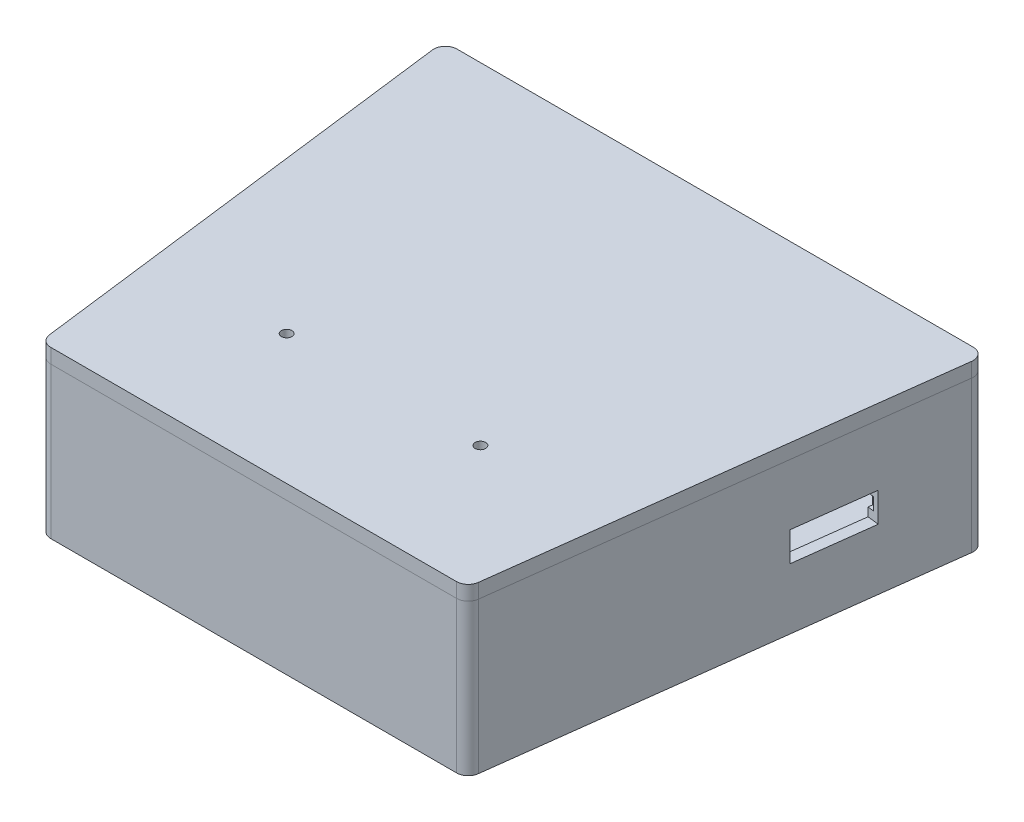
ISO-10303-21;
HEADER;
FILE_DESCRIPTION(('STEP AP214'),'2;1');
FILE_NAME('part.step','',(''),(''),'','','');
FILE_SCHEMA(('AUTOMOTIVE_DESIGN { 1 0 10303 214 1 1 1 1 }'));
ENDSEC;
DATA;
#1=APPLICATION_CONTEXT('core data for automotive mechanical design processes');
#2=APPLICATION_PROTOCOL_DEFINITION('international standard','automotive_design',2000,#1);
#3=PRODUCT_CONTEXT('',#1,'mechanical');
#4=PRODUCT('Part','Part','',(#3));
#5=PRODUCT_RELATED_PRODUCT_CATEGORY('part','',(#4));
#6=PRODUCT_DEFINITION_FORMATION('','',#4);
#7=PRODUCT_DEFINITION_CONTEXT('part definition',#1,'design');
#8=PRODUCT_DEFINITION('design','',#6,#7);
#9=PRODUCT_DEFINITION_SHAPE('','',#8);
#10=(LENGTH_UNIT() NAMED_UNIT(*) SI_UNIT(.MILLI.,.METRE.));
#11=(NAMED_UNIT(*) PLANE_ANGLE_UNIT() SI_UNIT($,.RADIAN.));
#12=(NAMED_UNIT(*) SI_UNIT($,.STERADIAN.) SOLID_ANGLE_UNIT());
#13=UNCERTAINTY_MEASURE_WITH_UNIT(LENGTH_MEASURE(1.E-05),#10,'distance_accuracy_value','');
#14=(GEOMETRIC_REPRESENTATION_CONTEXT(3) GLOBAL_UNCERTAINTY_ASSIGNED_CONTEXT((#13)) GLOBAL_UNIT_ASSIGNED_CONTEXT((#10,
#11,#12)) REPRESENTATION_CONTEXT('',''));
#15=CARTESIAN_POINT('',(0.,0.,0.));
#16=DIRECTION('',(0.,0.,1.));
#17=DIRECTION('',(1.,0.,0.));
#18=AXIS2_PLACEMENT_3D('',#15,#16,#17);
#19=CARTESIAN_POINT('',(-14.7298660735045,54.2925,-147.394687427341));
#20=DIRECTION('',(0.,1.,0.));
#21=DIRECTION('',(0.,0.,1.));
#22=AXIS2_PLACEMENT_3D('',#19,#20,#21);
#23=PLANE('',#22);
#24=CARTESIAN_POINT('',(101.6,54.2925,-42.545));
#25=DIRECTION('',(0.,1.,0.));
#26=DIRECTION('',(0.,0.,1.));
#27=AXIS2_PLACEMENT_3D('',#24,#25,#26);
#28=CIRCLE('',#27,1.7272);
#29=CARTESIAN_POINT('',(101.6,54.2925,-44.2722));
#30=VERTEX_POINT('',#29);
#31=EDGE_CURVE('E201',#30,#30,#28,.T.);
#32=ORIENTED_EDGE('',*,*,#31,.F.);
#33=EDGE_LOOP('',(#32));
#34=FACE_BOUND('',#33,.T.);
#35=CARTESIAN_POINT('',(-14.7298660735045,54.2925,-147.394687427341));
#36=DIRECTION('',(0.,1.,0.));
#37=DIRECTION('',(0.,0.,1.));
#38=AXIS2_PLACEMENT_3D('',#35,#36,#37);
#39=CIRCLE('',#38,3.81);
#40=CARTESIAN_POINT('',(-14.7298660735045,54.2925,-151.204687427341));
#41=VERTEX_POINT('',#40);
#42=CARTESIAN_POINT('',(-18.5099832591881,54.2925,-146.918437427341));
#43=VERTEX_POINT('',#42);
#44=EDGE_CURVE('E212',#41,#43,#39,.T.);
#45=ORIENTED_EDGE('',*,*,#44,.T.);
#46=DIRECTION('',(0.125,0.,0.992156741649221));
#47=VECTOR('',#46,1.);
#48=CARTESIAN_POINT('',(-18.5099832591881,54.2925,-146.918437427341));
#49=LINE('',#48,#47);
#50=CARTESIAN_POINT('',(-0.420013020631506,54.2925,-3.33375000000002));
#51=VERTEX_POINT('',#50);
#52=EDGE_CURVE('E160',#43,#51,#49,.T.);
#53=ORIENTED_EDGE('',*,*,#52,.T.);
#54=CARTESIAN_POINT('',(3.36010416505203,54.2925,-3.81));
#55=DIRECTION('',(0.,1.,0.));
#56=DIRECTION('',(0.,0.,1.));
#57=AXIS2_PLACEMENT_3D('',#54,#55,#56);
#58=CIRCLE('',#57,3.81);
#59=CARTESIAN_POINT('',(3.36010416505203,54.2925,0.));
#60=VERTEX_POINT('',#59);
#61=EDGE_CURVE('E227',#51,#60,#58,.T.);
#62=ORIENTED_EDGE('',*,*,#61,.T.);
#63=DIRECTION('',(1.,0.,0.));
#64=VECTOR('',#63,1.);
#65=CARTESIAN_POINT('',(3.36010416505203,54.2925,0.));
#66=LINE('',#65,#64);
#67=CARTESIAN_POINT('',(136.339895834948,54.2925,0.));
#68=VERTEX_POINT('',#67);
#69=EDGE_CURVE('E240',#60,#68,#66,.T.);
#70=ORIENTED_EDGE('',*,*,#69,.T.);
#71=CARTESIAN_POINT('',(136.339895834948,54.2925,-3.81000000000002));
#72=DIRECTION('',(0.,1.,0.));
#73=DIRECTION('',(0.,0.,1.));
#74=AXIS2_PLACEMENT_3D('',#71,#72,#73);
#75=CIRCLE('',#74,3.80999999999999);
#76=CARTESIAN_POINT('',(140.120013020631,54.2925,-3.33375000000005));
#77=VERTEX_POINT('',#76);
#78=EDGE_CURVE('E179',#68,#77,#75,.T.);
#79=ORIENTED_EDGE('',*,*,#78,.T.);
#80=DIRECTION('',(0.125,0.,-0.992156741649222));
#81=VECTOR('',#80,1.);
#82=CARTESIAN_POINT('',(140.120013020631,54.2925,-3.33375000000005));
#83=LINE('',#82,#81);
#84=CARTESIAN_POINT('',(158.209983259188,54.2925,-146.918437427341));
#85=VERTEX_POINT('',#84);
#86=EDGE_CURVE('E173',#77,#85,#83,.T.);
#87=ORIENTED_EDGE('',*,*,#86,.T.);
#88=CARTESIAN_POINT('',(154.429866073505,54.2925,-147.394687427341));
#89=DIRECTION('',(0.,1.,0.));
#90=DIRECTION('',(0.,0.,1.));
#91=AXIS2_PLACEMENT_3D('',#88,#89,#90);
#92=CIRCLE('',#91,3.81);
#93=CARTESIAN_POINT('',(154.429866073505,54.2925,-151.204687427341));
#94=VERTEX_POINT('',#93);
#95=EDGE_CURVE('E177',#85,#94,#92,.T.);
#96=ORIENTED_EDGE('',*,*,#95,.T.);
#97=DIRECTION('',(-1.,0.,0.));
#98=VECTOR('',#97,1.);
#99=CARTESIAN_POINT('',(154.429866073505,54.2925,-151.204687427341));
#100=LINE('',#99,#98);
#101=EDGE_CURVE('E117',#94,#41,#100,.T.);
#102=ORIENTED_EDGE('',*,*,#101,.T.);
#103=EDGE_LOOP('',(#45,#53,#62,#70,#79,#87,#96,#102));
#104=FACE_BOUND('',#103,.T.);
#105=CARTESIAN_POINT('',(38.1,54.2925,-42.545));
#106=DIRECTION('',(0.,1.,0.));
#107=DIRECTION('',(0.,0.,1.));
#108=AXIS2_PLACEMENT_3D('',#105,#106,#107);
#109=CIRCLE('',#108,1.7272);
#110=CARTESIAN_POINT('',(38.1,54.2925,-44.2722));
#111=VERTEX_POINT('',#110);
#112=EDGE_CURVE('E249',#111,#111,#109,.T.);
#113=ORIENTED_EDGE('',*,*,#112,.F.);
#114=EDGE_LOOP('',(#113));
#115=FACE_BOUND('',#114,.T.);
#116=ADVANCED_FACE('F100',(#34,#104,#115),#23,.T.);
#117=CARTESIAN_POINT('',(-14.7298660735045,49.53,-147.394687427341));
#118=DIRECTION('',(0.,1.,0.));
#119=DIRECTION('',(0.,0.,1.));
#120=AXIS2_PLACEMENT_3D('',#117,#118,#119);
#121=PLANE('',#120);
#122=CARTESIAN_POINT('',(-14.7298660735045,49.53,-147.394687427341));
#123=DIRECTION('',(0.,1.,0.));
#124=DIRECTION('',(0.,0.,1.));
#125=AXIS2_PLACEMENT_3D('',#122,#123,#124);
#126=CIRCLE('',#125,3.81);
#127=CARTESIAN_POINT('',(-14.7298660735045,49.53,-151.204687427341));
#128=VERTEX_POINT('',#127);
#129=CARTESIAN_POINT('',(-18.5099832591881,49.53,-146.918437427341));
#130=VERTEX_POINT('',#129);
#131=EDGE_CURVE('E197',#128,#130,#126,.T.);
#132=ORIENTED_EDGE('',*,*,#131,.F.);
#133=DIRECTION('',(-1.,0.,0.));
#134=VECTOR('',#133,1.);
#135=CARTESIAN_POINT('',(154.429866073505,49.53,-151.204687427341));
#136=LINE('',#135,#134);
#137=CARTESIAN_POINT('',(154.429866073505,49.53,-151.204687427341));
#138=VERTEX_POINT('',#137);
#139=EDGE_CURVE('E152',#138,#128,#136,.T.);
#140=ORIENTED_EDGE('',*,*,#139,.F.);
#141=CARTESIAN_POINT('',(154.429866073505,49.53,-147.394687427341));
#142=DIRECTION('',(0.,1.,0.));
#143=DIRECTION('',(0.,0.,1.));
#144=AXIS2_PLACEMENT_3D('',#141,#142,#143);
#145=CIRCLE('',#144,3.81);
#146=CARTESIAN_POINT('',(158.209983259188,49.53,-146.918437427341));
#147=VERTEX_POINT('',#146);
#148=EDGE_CURVE('E146',#147,#138,#145,.T.);
#149=ORIENTED_EDGE('',*,*,#148,.F.);
#150=DIRECTION('',(0.125,0.,-0.992156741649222));
#151=VECTOR('',#150,1.);
#152=CARTESIAN_POINT('',(140.120013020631,49.53,-3.33375000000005));
#153=LINE('',#152,#151);
#154=CARTESIAN_POINT('',(140.120013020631,49.53,-3.33375000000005));
#155=VERTEX_POINT('',#154);
#156=EDGE_CURVE('E187',#155,#147,#153,.T.);
#157=ORIENTED_EDGE('',*,*,#156,.F.);
#158=CARTESIAN_POINT('',(136.339895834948,49.53,-3.81000000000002));
#159=DIRECTION('',(0.,1.,0.));
#160=DIRECTION('',(0.,0.,1.));
#161=AXIS2_PLACEMENT_3D('',#158,#159,#160);
#162=CIRCLE('',#161,3.80999999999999);
#163=CARTESIAN_POINT('',(136.339895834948,49.53,0.));
#164=VERTEX_POINT('',#163);
#165=EDGE_CURVE('E207',#164,#155,#162,.T.);
#166=ORIENTED_EDGE('',*,*,#165,.F.);
#167=DIRECTION('',(1.,0.,0.));
#168=VECTOR('',#167,1.);
#169=CARTESIAN_POINT('',(3.36010416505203,49.53,0.));
#170=LINE('',#169,#168);
#171=CARTESIAN_POINT('',(3.36010416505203,49.53,0.));
#172=VERTEX_POINT('',#171);
#173=EDGE_CURVE('E205',#172,#164,#170,.T.);
#174=ORIENTED_EDGE('',*,*,#173,.F.);
#175=CARTESIAN_POINT('',(3.36010416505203,49.53,-3.81));
#176=DIRECTION('',(0.,1.,0.));
#177=DIRECTION('',(0.,0.,1.));
#178=AXIS2_PLACEMENT_3D('',#175,#176,#177);
#179=CIRCLE('',#178,3.81);
#180=CARTESIAN_POINT('',(-0.420013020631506,49.53,-3.33375000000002));
#181=VERTEX_POINT('',#180);
#182=EDGE_CURVE('E203',#181,#172,#179,.T.);
#183=ORIENTED_EDGE('',*,*,#182,.F.);
#184=DIRECTION('',(0.125,0.,0.992156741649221));
#185=VECTOR('',#184,1.);
#186=CARTESIAN_POINT('',(-18.5099832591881,49.53,-146.918437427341));
#187=LINE('',#186,#185);
#188=EDGE_CURVE('E200',#130,#181,#187,.T.);
#189=ORIENTED_EDGE('',*,*,#188,.F.);
#190=EDGE_LOOP('',(#132,#140,#149,#157,#166,#174,#183,#189));
#191=FACE_BOUND('',#190,.T.);
#192=CARTESIAN_POINT('',(101.6,49.53,-42.545));
#193=DIRECTION('',(0.,1.,0.));
#194=DIRECTION('',(0.,0.,1.));
#195=AXIS2_PLACEMENT_3D('',#192,#193,#194);
#196=CIRCLE('',#195,1.7272);
#197=CARTESIAN_POINT('',(101.6,49.53,-44.2722));
#198=VERTEX_POINT('',#197);
#199=EDGE_CURVE('E246',#198,#198,#196,.T.);
#200=ORIENTED_EDGE('',*,*,#199,.T.);
#201=EDGE_LOOP('',(#200));
#202=FACE_BOUND('',#201,.T.);
#203=CARTESIAN_POINT('',(38.1,49.53,-42.545));
#204=DIRECTION('',(0.,1.,0.));
#205=DIRECTION('',(0.,0.,1.));
#206=AXIS2_PLACEMENT_3D('',#203,#204,#205);
#207=CIRCLE('',#206,1.7272);
#208=CARTESIAN_POINT('',(38.1,49.53,-44.2722));
#209=VERTEX_POINT('',#208);
#210=EDGE_CURVE('E252',#209,#209,#207,.T.);
#211=ORIENTED_EDGE('',*,*,#210,.T.);
#212=EDGE_LOOP('',(#211));
#213=FACE_BOUND('',#212,.T.);
#214=ADVANCED_FACE('F231',(#191,#202,#213),#121,.F.);
#215=CARTESIAN_POINT('',(-14.7298660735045,54.2925,-147.394687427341));
#216=DIRECTION('',(0.,-1.,0.));
#217=DIRECTION('',(0.,0.,-1.));
#218=AXIS2_PLACEMENT_3D('',#215,#216,#217);
#219=CYLINDRICAL_SURFACE('',#218,3.81);
#220=ORIENTED_EDGE('',*,*,#131,.T.);
#221=DIRECTION('',(0.,-1.,0.));
#222=VECTOR('',#221,1.);
#223=CARTESIAN_POINT('',(-18.5099832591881,54.2925,-146.918437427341));
#224=LINE('',#223,#222);
#225=EDGE_CURVE('E13',#43,#130,#224,.T.);
#226=ORIENTED_EDGE('',*,*,#225,.F.);
#227=ORIENTED_EDGE('',*,*,#44,.F.);
#228=DIRECTION('',(0.,-1.,0.));
#229=VECTOR('',#228,1.);
#230=CARTESIAN_POINT('',(-14.7298660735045,54.2925,-151.204687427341));
#231=LINE('',#230,#229);
#232=EDGE_CURVE('E193',#41,#128,#231,.T.);
#233=ORIENTED_EDGE('',*,*,#232,.T.);
#234=EDGE_LOOP('',(#220,#226,#227,#233));
#235=FACE_BOUND('',#234,.T.);
#236=ADVANCED_FACE('F102',(#235),#219,.T.);
#237=CARTESIAN_POINT('',(-18.5099832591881,54.2925,-146.918437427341));
#238=DIRECTION('',(0.992156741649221,0.,-0.125));
#239=DIRECTION('',(-0.125,0.,-0.992156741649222));
#240=AXIS2_PLACEMENT_3D('',#237,#238,#239);
#241=PLANE('',#240);
#242=ORIENTED_EDGE('',*,*,#188,.T.);
#243=DIRECTION('',(0.,-1.,0.));
#244=VECTOR('',#243,1.);
#245=CARTESIAN_POINT('',(-0.420013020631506,54.2925,-3.33375000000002));
#246=LINE('',#245,#244);
#247=EDGE_CURVE('E109',#51,#181,#246,.T.);
#248=ORIENTED_EDGE('',*,*,#247,.F.);
#249=ORIENTED_EDGE('',*,*,#52,.F.);
#250=ORIENTED_EDGE('',*,*,#225,.T.);
#251=EDGE_LOOP('',(#242,#248,#249,#250));
#252=FACE_BOUND('',#251,.T.);
#253=ADVANCED_FACE('F284',(#252),#241,.F.);
#254=CARTESIAN_POINT('',(3.36010416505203,54.2925,-3.81));
#255=DIRECTION('',(0.,-1.,0.));
#256=DIRECTION('',(0.,0.,-1.));
#257=AXIS2_PLACEMENT_3D('',#254,#255,#256);
#258=CYLINDRICAL_SURFACE('',#257,3.81);
#259=ORIENTED_EDGE('',*,*,#182,.T.);
#260=DIRECTION('',(0.,-1.,0.));
#261=VECTOR('',#260,1.);
#262=CARTESIAN_POINT('',(3.36010416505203,54.2925,0.));
#263=LINE('',#262,#261);
#264=EDGE_CURVE('E219',#60,#172,#263,.T.);
#265=ORIENTED_EDGE('',*,*,#264,.F.);
#266=ORIENTED_EDGE('',*,*,#61,.F.);
#267=ORIENTED_EDGE('',*,*,#247,.T.);
#268=EDGE_LOOP('',(#259,#265,#266,#267));
#269=FACE_BOUND('',#268,.T.);
#270=ADVANCED_FACE('F225',(#269),#258,.T.);
#271=CARTESIAN_POINT('',(3.36010416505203,54.2925,0.));
#272=DIRECTION('',(0.,0.,-1.));
#273=DIRECTION('',(-1.,0.,0.));
#274=AXIS2_PLACEMENT_3D('',#271,#272,#273);
#275=PLANE('',#274);
#276=ORIENTED_EDGE('',*,*,#173,.T.);
#277=DIRECTION('',(0.,-1.,0.));
#278=VECTOR('',#277,1.);
#279=CARTESIAN_POINT('',(136.339895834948,54.2925,0.));
#280=LINE('',#279,#278);
#281=EDGE_CURVE('E216',#68,#164,#280,.T.);
#282=ORIENTED_EDGE('',*,*,#281,.F.);
#283=ORIENTED_EDGE('',*,*,#69,.F.);
#284=ORIENTED_EDGE('',*,*,#264,.T.);
#285=EDGE_LOOP('',(#276,#282,#283,#284));
#286=FACE_BOUND('',#285,.T.);
#287=ADVANCED_FACE('F236',(#286),#275,.F.);
#288=CARTESIAN_POINT('',(136.339895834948,54.2925,-3.81000000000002));
#289=DIRECTION('',(0.,-1.,0.));
#290=DIRECTION('',(0.,0.,-1.));
#291=AXIS2_PLACEMENT_3D('',#288,#289,#290);
#292=CYLINDRICAL_SURFACE('',#291,3.80999999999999);
#293=ORIENTED_EDGE('',*,*,#165,.T.);
#294=DIRECTION('',(0.,-1.,0.));
#295=VECTOR('',#294,1.);
#296=CARTESIAN_POINT('',(140.120013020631,54.2925,-3.33375000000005));
#297=LINE('',#296,#295);
#298=EDGE_CURVE('E188',#77,#155,#297,.T.);
#299=ORIENTED_EDGE('',*,*,#298,.F.);
#300=ORIENTED_EDGE('',*,*,#78,.F.);
#301=ORIENTED_EDGE('',*,*,#281,.T.);
#302=EDGE_LOOP('',(#293,#299,#300,#301));
#303=FACE_BOUND('',#302,.T.);
#304=ADVANCED_FACE('F239',(#303),#292,.T.);
#305=CARTESIAN_POINT('',(140.120013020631,54.2925,-3.33375000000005));
#306=DIRECTION('',(-0.992156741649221,0.,-0.125));
#307=DIRECTION('',(-0.125,0.,0.992156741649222));
#308=AXIS2_PLACEMENT_3D('',#305,#306,#307);
#309=PLANE('',#308);
#310=ORIENTED_EDGE('',*,*,#156,.T.);
#311=DIRECTION('',(0.,-1.,0.));
#312=VECTOR('',#311,1.);
#313=CARTESIAN_POINT('',(158.209983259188,54.2925,-146.918437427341));
#314=LINE('',#313,#312);
#315=EDGE_CURVE('E184',#85,#147,#314,.T.);
#316=ORIENTED_EDGE('',*,*,#315,.F.);
#317=ORIENTED_EDGE('',*,*,#86,.F.);
#318=ORIENTED_EDGE('',*,*,#298,.T.);
#319=EDGE_LOOP('',(#310,#316,#317,#318));
#320=FACE_BOUND('',#319,.T.);
#321=ADVANCED_FACE('F185',(#320),#309,.F.);
#322=CARTESIAN_POINT('',(154.429866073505,54.2925,-147.394687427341));
#323=DIRECTION('',(0.,-1.,0.));
#324=DIRECTION('',(0.,0.,-1.));
#325=AXIS2_PLACEMENT_3D('',#322,#323,#324);
#326=CYLINDRICAL_SURFACE('',#325,3.81);
#327=ORIENTED_EDGE('',*,*,#148,.T.);
#328=DIRECTION('',(0.,-1.,0.));
#329=VECTOR('',#328,1.);
#330=CARTESIAN_POINT('',(154.429866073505,54.2925,-151.204687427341));
#331=LINE('',#330,#329);
#332=EDGE_CURVE('E189',#94,#138,#331,.T.);
#333=ORIENTED_EDGE('',*,*,#332,.F.);
#334=ORIENTED_EDGE('',*,*,#95,.F.);
#335=ORIENTED_EDGE('',*,*,#315,.T.);
#336=EDGE_LOOP('',(#327,#333,#334,#335));
#337=FACE_BOUND('',#336,.T.);
#338=ADVANCED_FACE('F191',(#337),#326,.T.);
#339=CARTESIAN_POINT('',(154.429866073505,54.2925,-151.204687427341));
#340=DIRECTION('',(0.,0.,1.));
#341=DIRECTION('',(1.,0.,0.));
#342=AXIS2_PLACEMENT_3D('',#339,#340,#341);
#343=PLANE('',#342);
#344=ORIENTED_EDGE('',*,*,#139,.T.);
#345=ORIENTED_EDGE('',*,*,#232,.F.);
#346=ORIENTED_EDGE('',*,*,#101,.F.);
#347=ORIENTED_EDGE('',*,*,#332,.T.);
#348=EDGE_LOOP('',(#344,#345,#346,#347));
#349=FACE_BOUND('',#348,.T.);
#350=ADVANCED_FACE('F272',(#349),#343,.F.);
#351=CARTESIAN_POINT('',(101.6,54.2925,-42.545));
#352=DIRECTION('',(0.,-1.,0.));
#353=DIRECTION('',(0.,0.,-1.));
#354=AXIS2_PLACEMENT_3D('',#351,#352,#353);
#355=CYLINDRICAL_SURFACE('',#354,1.7272);
#356=CARTESIAN_POINT('',(101.6,54.2925,-44.2722));
#357=CARTESIAN_POINT('',(101.6,54.242890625,-44.2722));
#358=CARTESIAN_POINT('',(101.6,54.19328125,-44.2722));
#359=CARTESIAN_POINT('',(101.6,54.0940625,-44.2722));
#360=CARTESIAN_POINT('',(101.6,54.044453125,-44.2722));
#361=CARTESIAN_POINT('',(101.6,53.945234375,-44.2722));
#362=CARTESIAN_POINT('',(101.6,53.895625,-44.2722));
#363=CARTESIAN_POINT('',(101.6,53.79640625,-44.2722));
#364=CARTESIAN_POINT('',(101.6,53.746796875,-44.2722));
#365=CARTESIAN_POINT('',(101.6,53.647578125,-44.2722));
#366=CARTESIAN_POINT('',(101.6,53.59796875,-44.2722));
#367=CARTESIAN_POINT('',(101.6,53.49875,-44.2722));
#368=CARTESIAN_POINT('',(101.6,53.449140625,-44.2722));
#369=CARTESIAN_POINT('',(101.6,53.349921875,-44.2722));
#370=CARTESIAN_POINT('',(101.6,53.3003125,-44.2722));
#371=CARTESIAN_POINT('',(101.6,53.20109375,-44.2722));
#372=CARTESIAN_POINT('',(101.6,53.151484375,-44.2722));
#373=CARTESIAN_POINT('',(101.6,53.052265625,-44.2722));
#374=CARTESIAN_POINT('',(101.6,53.00265625,-44.2722));
#375=CARTESIAN_POINT('',(101.6,52.9034375,-44.2722));
#376=CARTESIAN_POINT('',(101.6,52.853828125,-44.2722));
#377=CARTESIAN_POINT('',(101.6,52.754609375,-44.2722));
#378=CARTESIAN_POINT('',(101.6,52.705,-44.2722));
#379=CARTESIAN_POINT('',(101.6,52.60578125,-44.2722));
#380=CARTESIAN_POINT('',(101.6,52.556171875,-44.2722));
#381=CARTESIAN_POINT('',(101.6,52.456953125,-44.2722));
#382=CARTESIAN_POINT('',(101.6,52.40734375,-44.2722));
#383=CARTESIAN_POINT('',(101.6,52.308125,-44.2722));
#384=CARTESIAN_POINT('',(101.6,52.258515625,-44.2722));
#385=CARTESIAN_POINT('',(101.6,52.159296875,-44.2722));
#386=CARTESIAN_POINT('',(101.6,52.1096875,-44.2722));
#387=CARTESIAN_POINT('',(101.6,52.01046875,-44.2722));
#388=CARTESIAN_POINT('',(101.6,51.960859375,-44.2722));
#389=CARTESIAN_POINT('',(101.6,51.861640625,-44.2722));
#390=CARTESIAN_POINT('',(101.6,51.81203125,-44.2722));
#391=CARTESIAN_POINT('',(101.6,51.7128125,-44.2722));
#392=CARTESIAN_POINT('',(101.6,51.663203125,-44.2722));
#393=CARTESIAN_POINT('',(101.6,51.563984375,-44.2722));
#394=CARTESIAN_POINT('',(101.6,51.514375,-44.2722));
#395=CARTESIAN_POINT('',(101.6,51.41515625,-44.2722));
#396=CARTESIAN_POINT('',(101.6,51.365546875,-44.2722));
#397=CARTESIAN_POINT('',(101.6,51.266328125,-44.2722));
#398=CARTESIAN_POINT('',(101.6,51.21671875,-44.2722));
#399=CARTESIAN_POINT('',(101.6,51.1175,-44.2722));
#400=CARTESIAN_POINT('',(101.6,51.067890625,-44.2722));
#401=CARTESIAN_POINT('',(101.6,50.968671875,-44.2722));
#402=CARTESIAN_POINT('',(101.6,50.9190625,-44.2722));
#403=CARTESIAN_POINT('',(101.6,50.81984375,-44.2722));
#404=CARTESIAN_POINT('',(101.6,50.770234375,-44.2722));
#405=CARTESIAN_POINT('',(101.6,50.671015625,-44.2722));
#406=CARTESIAN_POINT('',(101.6,50.62140625,-44.2722));
#407=CARTESIAN_POINT('',(101.6,50.5221875,-44.2722));
#408=CARTESIAN_POINT('',(101.6,50.472578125,-44.2722));
#409=CARTESIAN_POINT('',(101.6,50.373359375,-44.2722));
#410=CARTESIAN_POINT('',(101.6,50.32375,-44.2722));
#411=CARTESIAN_POINT('',(101.6,50.22453125,-44.2722));
#412=CARTESIAN_POINT('',(101.6,50.174921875,-44.2722));
#413=CARTESIAN_POINT('',(101.6,50.075703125,-44.2722));
#414=CARTESIAN_POINT('',(101.6,50.02609375,-44.2722));
#415=CARTESIAN_POINT('',(101.6,49.926875,-44.2722));
#416=CARTESIAN_POINT('',(101.6,49.877265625,-44.2722));
#417=CARTESIAN_POINT('',(101.6,49.778046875,-44.2722));
#418=CARTESIAN_POINT('',(101.6,49.7284375,-44.2722));
#419=CARTESIAN_POINT('',(101.6,49.62921875,-44.2722));
#420=CARTESIAN_POINT('',(101.6,49.579609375,-44.2722));
#421=CARTESIAN_POINT('',(101.6,49.53,-44.2722));
#422=B_SPLINE_CURVE_WITH_KNOTS('',3,(#356,#357,#358,#359,#360,#361,#362,#363,#364,#365,#366,
#367,#368,#369,#370,#371,#372,#373,#374,#375,#376,#377,#378,#379,#380,#381,#382,#383,#384,#385,
#386,#387,#388,#389,#390,#391,#392,#393,#394,#395,#396,#397,#398,#399,#400,#401,#402,#403,#404,
#405,#406,#407,#408,#409,#410,#411,#412,#413,#414,#415,#416,#417,#418,#419,#420,#421),
.UNSPECIFIED.,.F.,.F.,(4,2,2,2,2,2,2,2,2,2,2,2,2,2,2,2,2,2,2,2,2,2,2,2,2,2,2,2,2,2,2,2,4),(0.,
0.148828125,0.29765625,0.446484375,0.5953125,0.744140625,0.892968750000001,1.041796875,1.190625,
1.339453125,1.48828125,1.637109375,1.7859375,1.934765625,2.08359375,2.232421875,2.38125,
2.530078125,2.67890625,2.827734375,2.9765625,3.125390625,3.27421875,3.423046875,3.571875,
3.720703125,3.86953125,4.018359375,4.1671875,4.316015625,4.46484375,4.613671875,4.7625),.UNSPECIFIED.);
#423=EDGE_CURVE('BSEAM269',#30,#198,#422,.T.);
#424=ORIENTED_EDGE('',*,*,#31,.T.);
#425=ORIENTED_EDGE('',*,*,#199,.F.);
#426=ORIENTED_EDGE('',*,*,#423,.T.);
#427=ORIENTED_EDGE('',*,*,#423,.F.);
#428=EDGE_LOOP('',(#424,#426,#425,#427));
#429=FACE_BOUND('',#428,.T.);
#430=ADVANCED_FACE('F269',(#429),#355,.F.);
#431=CARTESIAN_POINT('',(38.1,54.2925,-42.545));
#432=DIRECTION('',(0.,-1.,0.));
#433=DIRECTION('',(0.,0.,-1.));
#434=AXIS2_PLACEMENT_3D('',#431,#432,#433);
#435=CYLINDRICAL_SURFACE('',#434,1.7272);
#436=CARTESIAN_POINT('',(38.1,54.2925,-44.2722));
#437=CARTESIAN_POINT('',(38.1,54.242890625,-44.2722));
#438=CARTESIAN_POINT('',(38.1,54.19328125,-44.2722));
#439=CARTESIAN_POINT('',(38.1,54.0940625,-44.2722));
#440=CARTESIAN_POINT('',(38.1,54.044453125,-44.2722));
#441=CARTESIAN_POINT('',(38.1,53.945234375,-44.2722));
#442=CARTESIAN_POINT('',(38.1,53.895625,-44.2722));
#443=CARTESIAN_POINT('',(38.1,53.79640625,-44.2722));
#444=CARTESIAN_POINT('',(38.1,53.746796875,-44.2722));
#445=CARTESIAN_POINT('',(38.1,53.647578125,-44.2722));
#446=CARTESIAN_POINT('',(38.1,53.59796875,-44.2722));
#447=CARTESIAN_POINT('',(38.1,53.49875,-44.2722));
#448=CARTESIAN_POINT('',(38.1,53.449140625,-44.2722));
#449=CARTESIAN_POINT('',(38.1,53.349921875,-44.2722));
#450=CARTESIAN_POINT('',(38.1,53.3003125,-44.2722));
#451=CARTESIAN_POINT('',(38.1,53.20109375,-44.2722));
#452=CARTESIAN_POINT('',(38.1,53.151484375,-44.2722));
#453=CARTESIAN_POINT('',(38.1,53.052265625,-44.2722));
#454=CARTESIAN_POINT('',(38.1,53.00265625,-44.2722));
#455=CARTESIAN_POINT('',(38.1,52.9034375,-44.2722));
#456=CARTESIAN_POINT('',(38.1,52.853828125,-44.2722));
#457=CARTESIAN_POINT('',(38.1,52.754609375,-44.2722));
#458=CARTESIAN_POINT('',(38.1,52.705,-44.2722));
#459=CARTESIAN_POINT('',(38.1,52.60578125,-44.2722));
#460=CARTESIAN_POINT('',(38.1,52.556171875,-44.2722));
#461=CARTESIAN_POINT('',(38.1,52.456953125,-44.2722));
#462=CARTESIAN_POINT('',(38.1,52.40734375,-44.2722));
#463=CARTESIAN_POINT('',(38.1,52.308125,-44.2722));
#464=CARTESIAN_POINT('',(38.1,52.258515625,-44.2722));
#465=CARTESIAN_POINT('',(38.1,52.159296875,-44.2722));
#466=CARTESIAN_POINT('',(38.1,52.1096875,-44.2722));
#467=CARTESIAN_POINT('',(38.1,52.01046875,-44.2722));
#468=CARTESIAN_POINT('',(38.1,51.960859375,-44.2722));
#469=CARTESIAN_POINT('',(38.1,51.861640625,-44.2722));
#470=CARTESIAN_POINT('',(38.1,51.81203125,-44.2722));
#471=CARTESIAN_POINT('',(38.1,51.7128125,-44.2722));
#472=CARTESIAN_POINT('',(38.1,51.663203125,-44.2722));
#473=CARTESIAN_POINT('',(38.1,51.563984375,-44.2722));
#474=CARTESIAN_POINT('',(38.1,51.514375,-44.2722));
#475=CARTESIAN_POINT('',(38.1,51.41515625,-44.2722));
#476=CARTESIAN_POINT('',(38.1,51.365546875,-44.2722));
#477=CARTESIAN_POINT('',(38.1,51.266328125,-44.2722));
#478=CARTESIAN_POINT('',(38.1,51.21671875,-44.2722));
#479=CARTESIAN_POINT('',(38.1,51.1175,-44.2722));
#480=CARTESIAN_POINT('',(38.1,51.067890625,-44.2722));
#481=CARTESIAN_POINT('',(38.1,50.968671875,-44.2722));
#482=CARTESIAN_POINT('',(38.1,50.9190625,-44.2722));
#483=CARTESIAN_POINT('',(38.1,50.81984375,-44.2722));
#484=CARTESIAN_POINT('',(38.1,50.770234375,-44.2722));
#485=CARTESIAN_POINT('',(38.1,50.671015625,-44.2722));
#486=CARTESIAN_POINT('',(38.1,50.62140625,-44.2722));
#487=CARTESIAN_POINT('',(38.1,50.5221875,-44.2722));
#488=CARTESIAN_POINT('',(38.1,50.472578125,-44.2722));
#489=CARTESIAN_POINT('',(38.1,50.373359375,-44.2722));
#490=CARTESIAN_POINT('',(38.1,50.32375,-44.2722));
#491=CARTESIAN_POINT('',(38.1,50.22453125,-44.2722));
#492=CARTESIAN_POINT('',(38.1,50.174921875,-44.2722));
#493=CARTESIAN_POINT('',(38.1,50.075703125,-44.2722));
#494=CARTESIAN_POINT('',(38.1,50.02609375,-44.2722));
#495=CARTESIAN_POINT('',(38.1,49.926875,-44.2722));
#496=CARTESIAN_POINT('',(38.1,49.877265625,-44.2722));
#497=CARTESIAN_POINT('',(38.1,49.778046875,-44.2722));
#498=CARTESIAN_POINT('',(38.1,49.7284375,-44.2722));
#499=CARTESIAN_POINT('',(38.1,49.62921875,-44.2722));
#500=CARTESIAN_POINT('',(38.1,49.579609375,-44.2722));
#501=CARTESIAN_POINT('',(38.1,49.53,-44.2722));
#502=B_SPLINE_CURVE_WITH_KNOTS('',3,(#436,#437,#438,#439,#440,#441,#442,#443,#444,#445,#446,
#447,#448,#449,#450,#451,#452,#453,#454,#455,#456,#457,#458,#459,#460,#461,#462,#463,#464,#465,
#466,#467,#468,#469,#470,#471,#472,#473,#474,#475,#476,#477,#478,#479,#480,#481,#482,#483,#484,
#485,#486,#487,#488,#489,#490,#491,#492,#493,#494,#495,#496,#497,#498,#499,#500,#501),
.UNSPECIFIED.,.F.,.F.,(4,2,2,2,2,2,2,2,2,2,2,2,2,2,2,2,2,2,2,2,2,2,2,2,2,2,2,2,2,2,2,2,4),(0.,
0.148828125,0.29765625,0.446484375,0.5953125,0.744140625,0.892968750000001,1.041796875,1.190625,
1.339453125,1.48828125,1.637109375,1.7859375,1.934765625,2.08359375,2.232421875,2.38125,
2.530078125,2.67890625,2.827734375,2.9765625,3.125390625,3.27421875,3.423046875,3.571875,
3.720703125,3.86953125,4.018359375,4.1671875,4.316015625,4.46484375,4.613671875,4.7625),.UNSPECIFIED.);
#503=EDGE_CURVE('BSEAM258',#111,#209,#502,.T.);
#504=ORIENTED_EDGE('',*,*,#112,.T.);
#505=ORIENTED_EDGE('',*,*,#210,.F.);
#506=ORIENTED_EDGE('',*,*,#503,.T.);
#507=ORIENTED_EDGE('',*,*,#503,.F.);
#508=EDGE_LOOP('',(#504,#506,#505,#507));
#509=FACE_BOUND('',#508,.T.);
#510=ADVANCED_FACE('F258',(#509),#435,.F.);
#511=CLOSED_SHELL('',(#116,#214,#236,#253,#270,#287,#304,#321,#338,#350,#430,#510));
#512=MANIFOLD_SOLID_BREP('B2',#511);
#513=CARTESIAN_POINT('',(-14.7298660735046,49.53,-147.394687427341));
#514=DIRECTION('',(0.992156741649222,0.,-0.125));
#515=DIRECTION('',(-0.125,0.,-0.992156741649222));
#516=AXIS2_PLACEMENT_3D('',#513,#514,#515);
#517=PLANE('',#516);
#518=DIRECTION('',(0.125,0.,0.992156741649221));
#519=VECTOR('',#518,1.);
#520=CARTESIAN_POINT('',(-14.7298660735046,5.08,-147.394687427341));
#521=LINE('',#520,#519);
#522=CARTESIAN_POINT('',(-14.1898493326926,5.08,-143.108437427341));
#523=VERTEX_POINT('',#522);
#524=CARTESIAN_POINT('',(2.94009114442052,5.08,-7.14375000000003));
#525=VERTEX_POINT('',#524);
#526=EDGE_CURVE('E879',#523,#525,#521,.T.);
#527=ORIENTED_EDGE('',*,*,#526,.F.);
#528=DIRECTION('',(0.,-1.,0.));
#529=VECTOR('',#528,1.);
#530=CARTESIAN_POINT('',(-14.1898493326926,49.53,-143.108437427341));
#531=LINE('',#530,#529);
#532=CARTESIAN_POINT('',(-14.1898493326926,49.53,-143.108437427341));
#533=VERTEX_POINT('',#532);
#534=EDGE_CURVE('E1000',#523,#533,#531,.F.);
#535=ORIENTED_EDGE('',*,*,#534,.T.);
#536=DIRECTION('',(0.125,0.,0.992156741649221));
#537=VECTOR('',#536,1.);
#538=CARTESIAN_POINT('',(-14.7298660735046,49.53,-147.394687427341));
#539=LINE('',#538,#537);
#540=CARTESIAN_POINT('',(2.94009114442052,49.53,-7.14375000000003));
#541=VERTEX_POINT('',#540);
#542=EDGE_CURVE('E866',#533,#541,#539,.T.);
#543=ORIENTED_EDGE('',*,*,#542,.T.);
#544=DIRECTION('',(0.,-1.,0.));
#545=VECTOR('',#544,1.);
#546=CARTESIAN_POINT('',(2.94009114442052,5.08000000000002,-7.14374999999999));
#547=LINE('',#546,#545);
#548=EDGE_CURVE('E997',#541,#525,#547,.T.);
#549=ORIENTED_EDGE('',*,*,#548,.T.);
#550=EDGE_LOOP('',(#527,#535,#543,#549));
#551=FACE_BOUND('',#550,.T.);
#552=DIRECTION('',(-0.125,0.,-0.992156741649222));
#553=VECTOR('',#552,1.);
#554=CARTESIAN_POINT('',(-8.06263281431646,19.939,-94.4751640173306));
#555=LINE('',#554,#553);
#556=CARTESIAN_POINT('',(-8.06263281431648,19.939,-94.4751640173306));
#557=VERTEX_POINT('',#556);
#558=CARTESIAN_POINT('',(-11.3011328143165,19.939,-120.179960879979));
#559=VERTEX_POINT('',#558);
#560=EDGE_CURVE('E1323',#557,#559,#555,.T.);
#561=ORIENTED_EDGE('',*,*,#560,.F.);
#562=DIRECTION('',(0.,-1.,0.));
#563=VECTOR('',#562,1.);
#564=CARTESIAN_POINT('',(-8.06263281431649,29.591,-94.4751640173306));
#565=LINE('',#564,#563);
#566=CARTESIAN_POINT('',(-8.06263281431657,22.733,-94.4751640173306));
#567=VERTEX_POINT('',#566);
#568=EDGE_CURVE('E711',#567,#557,#565,.T.);
#569=ORIENTED_EDGE('',*,*,#568,.F.);
#570=DIRECTION('',(0.125000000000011,0.,0.99215674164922));
#571=VECTOR('',#570,1.);
#572=CARTESIAN_POINT('',(-8.06263281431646,22.733,-94.4751640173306));
#573=LINE('',#572,#571);
#574=CARTESIAN_POINT('',(-7.90388281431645,22.733,-93.2151249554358));
#575=VERTEX_POINT('',#574);
#576=EDGE_CURVE('E1427',#567,#575,#573,.T.);
#577=ORIENTED_EDGE('',*,*,#576,.T.);
#578=DIRECTION('',(0.,1.,0.));
#579=VECTOR('',#578,1.);
#580=CARTESIAN_POINT('',(-7.90388281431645,26.797,-93.2151249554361));
#581=LINE('',#580,#579);
#582=CARTESIAN_POINT('',(-7.90388281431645,26.797,-93.2151249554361));
#583=VERTEX_POINT('',#582);
#584=EDGE_CURVE('E725',#575,#583,#581,.T.);
#585=ORIENTED_EDGE('',*,*,#584,.T.);
#586=DIRECTION('',(-0.125000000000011,0.,-0.99215674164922));
#587=VECTOR('',#586,1.);
#588=CARTESIAN_POINT('',(-8.06263281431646,26.797,-94.4751640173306));
#589=LINE('',#588,#587);
#590=CARTESIAN_POINT('',(-8.06263281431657,26.797,-94.4751640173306));
#591=VERTEX_POINT('',#590);
#592=EDGE_CURVE('E716',#583,#591,#589,.T.);
#593=ORIENTED_EDGE('',*,*,#592,.T.);
#594=CARTESIAN_POINT('',(-8.06263281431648,29.591,-94.4751640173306));
#595=VERTEX_POINT('',#594);
#596=EDGE_CURVE('E698',#595,#591,#565,.T.);
#597=ORIENTED_EDGE('',*,*,#596,.F.);
#598=DIRECTION('',(0.125,0.,0.992156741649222));
#599=VECTOR('',#598,1.);
#600=CARTESIAN_POINT('',(-8.06263281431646,29.591,-94.4751640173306));
#601=LINE('',#600,#599);
#602=CARTESIAN_POINT('',(-11.3011328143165,29.591,-120.179960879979));
#603=VERTEX_POINT('',#602);
#604=EDGE_CURVE('E709',#603,#595,#601,.T.);
#605=ORIENTED_EDGE('',*,*,#604,.F.);
#606=DIRECTION('',(0.,1.,0.));
#607=VECTOR('',#606,1.);
#608=CARTESIAN_POINT('',(-11.3011328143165,29.591,-120.179960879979));
#609=LINE('',#608,#607);
#610=CARTESIAN_POINT('',(-11.3011328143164,26.797,-120.179960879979));
#611=VERTEX_POINT('',#610);
#612=EDGE_CURVE('E1322',#611,#603,#609,.T.);
#613=ORIENTED_EDGE('',*,*,#612,.F.);
#614=DIRECTION('',(-0.125000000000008,0.,-0.992156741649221));
#615=VECTOR('',#614,1.);
#616=CARTESIAN_POINT('',(-11.3011328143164,26.797,-120.179960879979));
#617=LINE('',#616,#615);
#618=CARTESIAN_POINT('',(-11.4598828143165,26.797,-121.439999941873));
#619=VERTEX_POINT('',#618);
#620=EDGE_CURVE('E744',#611,#619,#617,.T.);
#621=ORIENTED_EDGE('',*,*,#620,.T.);
#622=DIRECTION('',(0.,-1.,0.));
#623=VECTOR('',#622,1.);
#624=CARTESIAN_POINT('',(-11.4598828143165,26.797,-121.439999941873));
#625=LINE('',#624,#623);
#626=CARTESIAN_POINT('',(-11.4598828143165,22.733,-121.439999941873));
#627=VERTEX_POINT('',#626);
#628=EDGE_CURVE('E750',#619,#627,#625,.T.);
#629=ORIENTED_EDGE('',*,*,#628,.T.);
#630=DIRECTION('',(0.125000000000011,0.,0.99215674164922));
#631=VECTOR('',#630,1.);
#632=CARTESIAN_POINT('',(-11.3011328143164,22.733,-120.179960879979));
#633=LINE('',#632,#631);
#634=CARTESIAN_POINT('',(-11.3011328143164,22.733,-120.179960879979));
#635=VERTEX_POINT('',#634);
#636=EDGE_CURVE('E755',#627,#635,#633,.T.);
#637=ORIENTED_EDGE('',*,*,#636,.T.);
#638=EDGE_CURVE('E1317',#559,#635,#609,.T.);
#639=ORIENTED_EDGE('',*,*,#638,.F.);
#640=EDGE_LOOP('',(#561,#569,#577,#585,#593,#597,#605,#613,#621,#629,#637,#639));
#641=FACE_BOUND('',#640,.T.);
#642=ADVANCED_FACE('F370',(#551,#641),#517,.T.);
#643=CARTESIAN_POINT('',(0.,5.08,0.));
#644=DIRECTION('',(0.992156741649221,0.,-0.125));
#645=DIRECTION('',(-0.125,0.,-0.992156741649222));
#646=AXIS2_PLACEMENT_3D('',#643,#644,#645);
#647=PLANE('',#646);
#648=DIRECTION('',(0.125,0.,0.992156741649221));
#649=VECTOR('',#648,1.);
#650=CARTESIAN_POINT('',(-19.05,49.53,-151.204687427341));
#651=LINE('',#650,#649);
#652=CARTESIAN_POINT('',(-18.5099832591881,49.53,-146.918437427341));
#653=VERTEX_POINT('',#652);
#654=CARTESIAN_POINT('',(-0.420013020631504,49.53,-3.33375000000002));
#655=VERTEX_POINT('',#654);
#656=EDGE_CURVE('E876',#653,#655,#651,.T.);
#657=ORIENTED_EDGE('',*,*,#656,.F.);
#658=DIRECTION('',(0.,-1.,0.));
#659=VECTOR('',#658,1.);
#660=CARTESIAN_POINT('',(-18.5099832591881,5.08,-146.918437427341));
#661=LINE('',#660,#659);
#662=CARTESIAN_POINT('',(-18.5099832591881,0.,-146.918437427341));
#663=VERTEX_POINT('',#662);
#664=EDGE_CURVE('E951',#653,#663,#661,.T.);
#665=ORIENTED_EDGE('',*,*,#664,.T.);
#666=DIRECTION('',(0.125,0.,0.992156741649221));
#667=VECTOR('',#666,1.);
#668=CARTESIAN_POINT('',(0.,0.,0.));
#669=LINE('',#668,#667);
#670=CARTESIAN_POINT('',(-0.420013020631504,0.,-3.33375));
#671=VERTEX_POINT('',#670);
#672=EDGE_CURVE('E898',#663,#671,#669,.T.);
#673=ORIENTED_EDGE('',*,*,#672,.T.);
#674=DIRECTION('',(0.,-1.,0.));
#675=VECTOR('',#674,1.);
#676=CARTESIAN_POINT('',(-0.420013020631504,5.08,-3.33375));
#677=LINE('',#676,#675);
#678=EDGE_CURVE('E949',#671,#655,#677,.F.);
#679=ORIENTED_EDGE('',*,*,#678,.T.);
#680=EDGE_LOOP('',(#657,#665,#673,#679));
#681=FACE_BOUND('',#680,.T.);
#682=DIRECTION('',(0.,-1.,0.));
#683=VECTOR('',#682,1.);
#684=CARTESIAN_POINT('',(-11.84275,29.591,-93.9989140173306));
#685=LINE('',#684,#683);
#686=CARTESIAN_POINT('',(-11.84275,29.591,-93.9989140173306));
#687=VERTEX_POINT('',#686);
#688=CARTESIAN_POINT('',(-11.84275,19.939,-93.9989140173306));
#689=VERTEX_POINT('',#688);
#690=EDGE_CURVE('E385',#687,#689,#685,.T.);
#691=ORIENTED_EDGE('',*,*,#690,.T.);
#692=DIRECTION('',(-0.124999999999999,0.,-0.992156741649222));
#693=VECTOR('',#692,1.);
#694=CARTESIAN_POINT('',(-11.84275,19.939,-93.9989140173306));
#695=LINE('',#694,#693);
#696=CARTESIAN_POINT('',(-15.08125,19.939,-119.703710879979));
#697=VERTEX_POINT('',#696);
#698=EDGE_CURVE('E1337',#689,#697,#695,.T.);
#699=ORIENTED_EDGE('',*,*,#698,.T.);
#700=DIRECTION('',(0.,1.,0.));
#701=VECTOR('',#700,1.);
#702=CARTESIAN_POINT('',(-15.08125,29.591,-119.703710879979));
#703=LINE('',#702,#701);
#704=CARTESIAN_POINT('',(-15.08125,29.591,-119.703710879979));
#705=VERTEX_POINT('',#704);
#706=EDGE_CURVE('E1336',#697,#705,#703,.T.);
#707=ORIENTED_EDGE('',*,*,#706,.T.);
#708=DIRECTION('',(0.124999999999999,0.,0.992156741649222));
#709=VECTOR('',#708,1.);
#710=CARTESIAN_POINT('',(-11.84275,29.591,-93.9989140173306));
#711=LINE('',#710,#709);
#712=EDGE_CURVE('E1340',#705,#687,#711,.T.);
#713=ORIENTED_EDGE('',*,*,#712,.T.);
#714=EDGE_LOOP('',(#691,#699,#707,#713));
#715=FACE_BOUND('',#714,.T.);
#716=ADVANCED_FACE('F1035',(#681,#715),#647,.F.);
#717=CARTESIAN_POINT('',(0.,5.08,0.));
#718=DIRECTION('',(0.,0.,-1.));
#719=DIRECTION('',(-1.,0.,0.));
#720=AXIS2_PLACEMENT_3D('',#717,#718,#719);
#721=PLANE('',#720);
#722=DIRECTION('',(1.,0.,0.));
#723=VECTOR('',#722,1.);
#724=CARTESIAN_POINT('',(0.,49.53,0.));
#725=LINE('',#724,#723);
#726=CARTESIAN_POINT('',(3.36010416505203,49.53,0.));
#727=VERTEX_POINT('',#726);
#728=CARTESIAN_POINT('',(136.339895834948,49.53,0.));
#729=VERTEX_POINT('',#728);
#730=EDGE_CURVE('E889',#727,#729,#725,.T.);
#731=ORIENTED_EDGE('',*,*,#730,.F.);
#732=DIRECTION('',(0.,-1.,0.));
#733=VECTOR('',#732,1.);
#734=CARTESIAN_POINT('',(3.36010416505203,5.08,0.));
#735=LINE('',#734,#733);
#736=CARTESIAN_POINT('',(3.36010416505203,0.,0.));
#737=VERTEX_POINT('',#736);
#738=EDGE_CURVE('E977',#727,#737,#735,.T.);
#739=ORIENTED_EDGE('',*,*,#738,.T.);
#740=DIRECTION('',(1.,0.,0.));
#741=VECTOR('',#740,1.);
#742=CARTESIAN_POINT('',(0.,0.,0.));
#743=LINE('',#742,#741);
#744=CARTESIAN_POINT('',(136.339895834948,0.,0.));
#745=VERTEX_POINT('',#744);
#746=EDGE_CURVE('E901',#737,#745,#743,.T.);
#747=ORIENTED_EDGE('',*,*,#746,.T.);
#748=DIRECTION('',(0.,-1.,0.));
#749=VECTOR('',#748,1.);
#750=CARTESIAN_POINT('',(136.339895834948,5.08,0.));
#751=LINE('',#750,#749);
#752=EDGE_CURVE('E975',#745,#729,#751,.F.);
#753=ORIENTED_EDGE('',*,*,#752,.T.);
#754=EDGE_LOOP('',(#731,#739,#747,#753));
#755=FACE_BOUND('',#754,.T.);
#756=ADVANCED_FACE('F1041',(#755),#721,.F.);
#757=CARTESIAN_POINT('',(139.7,5.08,0.));
#758=DIRECTION('',(-0.992156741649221,0.,-0.125));
#759=DIRECTION('',(-0.125,0.,0.992156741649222));
#760=AXIS2_PLACEMENT_3D('',#757,#758,#759);
#761=PLANE('',#760);
#762=DIRECTION('',(0.,1.,0.));
#763=VECTOR('',#762,1.);
#764=CARTESIAN_POINT('',(154.78125,29.591,-119.703710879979));
#765=LINE('',#764,#763);
#766=CARTESIAN_POINT('',(154.78125,19.939,-119.703710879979));
#767=VERTEX_POINT('',#766);
#768=CARTESIAN_POINT('',(154.78125,29.591,-119.703710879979));
#769=VERTEX_POINT('',#768);
#770=EDGE_CURVE('E830',#767,#769,#765,.T.);
#771=ORIENTED_EDGE('',*,*,#770,.F.);
#772=DIRECTION('',(0.124999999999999,0.,-0.992156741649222));
#773=VECTOR('',#772,1.);
#774=CARTESIAN_POINT('',(151.54275,19.939,-93.9989140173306));
#775=LINE('',#774,#773);
#776=CARTESIAN_POINT('',(151.54275,19.939,-93.9989140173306));
#777=VERTEX_POINT('',#776);
#778=EDGE_CURVE('E827',#777,#767,#775,.T.);
#779=ORIENTED_EDGE('',*,*,#778,.F.);
#780=DIRECTION('',(0.,-1.,0.));
#781=VECTOR('',#780,1.);
#782=CARTESIAN_POINT('',(151.54275,29.591,-93.9989140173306));
#783=LINE('',#782,#781);
#784=CARTESIAN_POINT('',(151.54275,29.591,-93.9989140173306));
#785=VERTEX_POINT('',#784);
#786=EDGE_CURVE('E824',#785,#777,#783,.T.);
#787=ORIENTED_EDGE('',*,*,#786,.F.);
#788=DIRECTION('',(-0.124999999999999,0.,0.992156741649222));
#789=VECTOR('',#788,1.);
#790=CARTESIAN_POINT('',(151.54275,29.591,-93.9989140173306));
#791=LINE('',#790,#789);
#792=EDGE_CURVE('E833',#769,#785,#791,.T.);
#793=ORIENTED_EDGE('',*,*,#792,.F.);
#794=EDGE_LOOP('',(#771,#779,#787,#793));
#795=FACE_BOUND('',#794,.T.);
#796=DIRECTION('',(0.125,0.,-0.992156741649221));
#797=VECTOR('',#796,1.);
#798=CARTESIAN_POINT('',(139.7,0.,0.));
#799=LINE('',#798,#797);
#800=CARTESIAN_POINT('',(140.120013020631,0.,-3.33375000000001));
#801=VERTEX_POINT('',#800);
#802=CARTESIAN_POINT('',(158.209983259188,0.,-146.918437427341));
#803=VERTEX_POINT('',#802);
#804=EDGE_CURVE('E904',#801,#803,#799,.T.);
#805=ORIENTED_EDGE('',*,*,#804,.T.);
#806=DIRECTION('',(0.,-1.,0.));
#807=VECTOR('',#806,1.);
#808=CARTESIAN_POINT('',(158.209983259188,5.08,-146.918437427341));
#809=LINE('',#808,#807);
#810=CARTESIAN_POINT('',(158.209983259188,49.53,-146.918437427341));
#811=VERTEX_POINT('',#810);
#812=EDGE_CURVE('E983',#803,#811,#809,.F.);
#813=ORIENTED_EDGE('',*,*,#812,.T.);
#814=DIRECTION('',(0.125,0.,-0.992156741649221));
#815=VECTOR('',#814,1.);
#816=CARTESIAN_POINT('',(158.75,49.53,-151.204687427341));
#817=LINE('',#816,#815);
#818=CARTESIAN_POINT('',(140.120013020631,49.53,-3.33375000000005));
#819=VERTEX_POINT('',#818);
#820=EDGE_CURVE('E892',#819,#811,#817,.T.);
#821=ORIENTED_EDGE('',*,*,#820,.F.);
#822=DIRECTION('',(0.,-1.,0.));
#823=VECTOR('',#822,1.);
#824=CARTESIAN_POINT('',(140.120013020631,5.08,-3.33375000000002));
#825=LINE('',#824,#823);
#826=EDGE_CURVE('E980',#819,#801,#825,.T.);
#827=ORIENTED_EDGE('',*,*,#826,.T.);
#828=EDGE_LOOP('',(#805,#813,#821,#827));
#829=FACE_BOUND('',#828,.T.);
#830=ADVANCED_FACE('F1072',(#795,#829),#761,.F.);
#831=CARTESIAN_POINT('',(-19.05,5.08,-151.204687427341));
#832=DIRECTION('',(0.,0.,1.));
#833=DIRECTION('',(1.,0.,0.));
#834=AXIS2_PLACEMENT_3D('',#831,#832,#833);
#835=PLANE('',#834);
#836=CARTESIAN_POINT('',(79.375,38.1,-151.204687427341));
#837=DIRECTION('',(0.,0.,-1.));
#838=DIRECTION('',(-1.,0.,0.));
#839=AXIS2_PLACEMENT_3D('',#836,#837,#838);
#840=CIRCLE('',#839,3.175);
#841=CARTESIAN_POINT('',(76.2,38.1,-151.204687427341));
#842=VERTEX_POINT('',#841);
#843=EDGE_CURVE('E854',#842,#842,#840,.T.);
#844=ORIENTED_EDGE('',*,*,#843,.F.);
#845=EDGE_LOOP('',(#844));
#846=FACE_BOUND('',#845,.T.);
#847=CARTESIAN_POINT('',(60.325,38.1,-151.204687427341));
#848=DIRECTION('',(0.,0.,-1.));
#849=DIRECTION('',(1.,0.,0.));
#850=AXIS2_PLACEMENT_3D('',#847,#848,#849);
#851=CIRCLE('',#850,3.175);
#852=CARTESIAN_POINT('',(63.5,38.1,-151.204687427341));
#853=VERTEX_POINT('',#852);
#854=EDGE_CURVE('E855',#853,#853,#851,.T.);
#855=ORIENTED_EDGE('',*,*,#854,.F.);
#856=EDGE_LOOP('',(#855));
#857=FACE_BOUND('',#856,.T.);
#858=DIRECTION('',(-1.,0.,0.));
#859=VECTOR('',#858,1.);
#860=CARTESIAN_POINT('',(-19.05,0.,-151.204687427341));
#861=LINE('',#860,#859);
#862=CARTESIAN_POINT('',(154.429866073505,0.,-151.204687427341));
#863=VERTEX_POINT('',#862);
#864=CARTESIAN_POINT('',(-14.7298660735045,0.,-151.204687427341));
#865=VERTEX_POINT('',#864);
#866=EDGE_CURVE('E907',#863,#865,#861,.T.);
#867=ORIENTED_EDGE('',*,*,#866,.T.);
#868=DIRECTION('',(0.,-1.,0.));
#869=VECTOR('',#868,1.);
#870=CARTESIAN_POINT('',(-14.7298660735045,5.08,-151.204687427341));
#871=LINE('',#870,#869);
#872=CARTESIAN_POINT('',(-14.7298660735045,49.53,-151.204687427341));
#873=VERTEX_POINT('',#872);
#874=EDGE_CURVE('E965',#865,#873,#871,.F.);
#875=ORIENTED_EDGE('',*,*,#874,.T.);
#876=DIRECTION('',(-1.,0.,0.));
#877=VECTOR('',#876,1.);
#878=CARTESIAN_POINT('',(-19.05,49.53,-151.204687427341));
#879=LINE('',#878,#877);
#880=CARTESIAN_POINT('',(154.429866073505,49.53,-151.204687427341));
#881=VERTEX_POINT('',#880);
#882=EDGE_CURVE('E895',#881,#873,#879,.T.);
#883=ORIENTED_EDGE('',*,*,#882,.F.);
#884=DIRECTION('',(0.,-1.,0.));
#885=VECTOR('',#884,1.);
#886=CARTESIAN_POINT('',(154.429866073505,5.08,-151.204687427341));
#887=LINE('',#886,#885);
#888=EDGE_CURVE('E962',#881,#863,#887,.T.);
#889=ORIENTED_EDGE('',*,*,#888,.T.);
#890=EDGE_LOOP('',(#867,#875,#883,#889));
#891=FACE_BOUND('',#890,.T.);
#892=ADVANCED_FACE('F1068',(#846,#857,#891),#835,.F.);
#893=CARTESIAN_POINT('',(0.,0.,0.));
#894=DIRECTION('',(0.,-1.,0.));
#895=DIRECTION('',(0.,0.,-1.));
#896=AXIS2_PLACEMENT_3D('',#893,#894,#895);
#897=PLANE('',#896);
#898=CARTESIAN_POINT('',(69.85,0.,-124.534687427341));
#899=DIRECTION('',(0.,-1.,0.));
#900=DIRECTION('',(0.,0.,-1.));
#901=AXIS2_PLACEMENT_3D('',#898,#899,#900);
#902=CIRCLE('',#901,11.43);
#903=CARTESIAN_POINT('',(69.85,0.,-135.964687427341));
#904=VERTEX_POINT('',#903);
#905=EDGE_CURVE('E847',#904,#904,#902,.T.);
#906=ORIENTED_EDGE('',*,*,#905,.F.);
#907=EDGE_LOOP('',(#906));
#908=FACE_BOUND('',#907,.T.);
#909=ORIENTED_EDGE('',*,*,#672,.F.);
#910=CARTESIAN_POINT('',(-14.7298660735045,0.,-147.394687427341));
#911=DIRECTION('',(0.,-1.,0.));
#912=DIRECTION('',(0.,0.,-1.));
#913=AXIS2_PLACEMENT_3D('',#910,#911,#912);
#914=CIRCLE('',#913,3.81);
#915=EDGE_CURVE('E960',#663,#865,#914,.T.);
#916=ORIENTED_EDGE('',*,*,#915,.T.);
#917=ORIENTED_EDGE('',*,*,#866,.F.);
#918=CARTESIAN_POINT('',(154.429866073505,0.,-147.394687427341));
#919=DIRECTION('',(0.,-1.,0.));
#920=DIRECTION('',(0.,0.,-1.));
#921=AXIS2_PLACEMENT_3D('',#918,#919,#920);
#922=CIRCLE('',#921,3.81);
#923=EDGE_CURVE('E956',#863,#803,#922,.T.);
#924=ORIENTED_EDGE('',*,*,#923,.T.);
#925=ORIENTED_EDGE('',*,*,#804,.F.);
#926=CARTESIAN_POINT('',(136.339895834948,0.,-3.81000000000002));
#927=DIRECTION('',(0.,-1.,0.));
#928=DIRECTION('',(0.,0.,-1.));
#929=AXIS2_PLACEMENT_3D('',#926,#927,#928);
#930=CIRCLE('',#929,3.81);
#931=EDGE_CURVE('E954',#801,#745,#930,.T.);
#932=ORIENTED_EDGE('',*,*,#931,.T.);
#933=ORIENTED_EDGE('',*,*,#746,.F.);
#934=CARTESIAN_POINT('',(3.36010416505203,0.,-3.81));
#935=DIRECTION('',(0.,-1.,0.));
#936=DIRECTION('',(0.,0.,-1.));
#937=AXIS2_PLACEMENT_3D('',#934,#935,#936);
#938=CIRCLE('',#937,3.81);
#939=EDGE_CURVE('E958',#737,#671,#938,.T.);
#940=ORIENTED_EDGE('',*,*,#939,.T.);
#941=EDGE_LOOP('',(#909,#916,#917,#924,#925,#932,#933,#940));
#942=FACE_BOUND('',#941,.T.);
#943=ADVANCED_FACE('F1056',(#908,#942),#897,.T.);
#944=CARTESIAN_POINT('',(0.,49.53,0.));
#945=DIRECTION('',(0.,1.,0.));
#946=DIRECTION('',(0.,0.,1.));
#947=AXIS2_PLACEMENT_3D('',#944,#945,#946);
#948=PLANE('',#947);
#949=ORIENTED_EDGE('',*,*,#882,.T.);
#950=CARTESIAN_POINT('',(-14.7298660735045,49.53,-147.394687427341));
#951=DIRECTION('',(0.,1.,0.));
#952=DIRECTION('',(0.,0.,1.));
#953=AXIS2_PLACEMENT_3D('',#950,#951,#952);
#954=CIRCLE('',#953,3.81);
#955=EDGE_CURVE('E973',#873,#653,#954,.T.);
#956=ORIENTED_EDGE('',*,*,#955,.T.);
#957=ORIENTED_EDGE('',*,*,#656,.T.);
#958=CARTESIAN_POINT('',(3.36010416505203,49.53,-3.81));
#959=DIRECTION('',(0.,1.,0.));
#960=DIRECTION('',(0.,0.,1.));
#961=AXIS2_PLACEMENT_3D('',#958,#959,#960);
#962=CIRCLE('',#961,3.81);
#963=EDGE_CURVE('E971',#655,#727,#962,.T.);
#964=ORIENTED_EDGE('',*,*,#963,.T.);
#965=ORIENTED_EDGE('',*,*,#730,.T.);
#966=CARTESIAN_POINT('',(136.339895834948,49.53,-3.81000000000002));
#967=DIRECTION('',(0.,1.,0.));
#968=DIRECTION('',(0.,0.,1.));
#969=AXIS2_PLACEMENT_3D('',#966,#967,#968);
#970=CIRCLE('',#969,3.81);
#971=EDGE_CURVE('E967',#729,#819,#970,.T.);
#972=ORIENTED_EDGE('',*,*,#971,.T.);
#973=ORIENTED_EDGE('',*,*,#820,.T.);
#974=CARTESIAN_POINT('',(154.429866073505,49.53,-147.394687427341));
#975=DIRECTION('',(0.,1.,0.));
#976=DIRECTION('',(0.,0.,1.));
#977=AXIS2_PLACEMENT_3D('',#974,#975,#976);
#978=CIRCLE('',#977,3.81);
#979=EDGE_CURVE('E969',#811,#881,#978,.T.);
#980=ORIENTED_EDGE('',*,*,#979,.T.);
#981=EDGE_LOOP('',(#949,#956,#957,#964,#965,#972,#973,#980));
#982=FACE_BOUND('',#981,.T.);
#983=ORIENTED_EDGE('',*,*,#542,.F.);
#984=CARTESIAN_POINT('',(-10.4097321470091,49.53,-143.584687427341));
#985=DIRECTION('',(0.,1.,0.));
#986=DIRECTION('',(0.,0.,1.));
#987=AXIS2_PLACEMENT_3D('',#984,#985,#986);
#988=CIRCLE('',#987,3.81);
#989=CARTESIAN_POINT('',(-10.4097321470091,49.53,-147.394687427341));
#990=VERTEX_POINT('',#989);
#991=EDGE_CURVE('E1011',#533,#990,#988,.F.);
#992=ORIENTED_EDGE('',*,*,#991,.T.);
#993=DIRECTION('',(-1.,0.,0.));
#994=VECTOR('',#993,1.);
#995=CARTESIAN_POINT('',(-14.7298660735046,49.53,-147.394687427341));
#996=LINE('',#995,#994);
#997=CARTESIAN_POINT('',(150.109732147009,49.53,-147.394687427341));
#998=VERTEX_POINT('',#997);
#999=EDGE_CURVE('E863',#998,#990,#996,.T.);
#1000=ORIENTED_EDGE('',*,*,#999,.F.);
#1001=CARTESIAN_POINT('',(150.109732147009,49.53,-143.584687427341));
#1002=DIRECTION('',(0.,1.,0.));
#1003=DIRECTION('',(0.,0.,1.));
#1004=AXIS2_PLACEMENT_3D('',#1001,#1002,#1003);
#1005=CIRCLE('',#1004,3.81);
#1006=CARTESIAN_POINT('',(153.889849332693,49.53,-143.108437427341));
#1007=VERTEX_POINT('',#1006);
#1008=EDGE_CURVE('E1013',#998,#1007,#1005,.F.);
#1009=ORIENTED_EDGE('',*,*,#1008,.T.);
#1010=DIRECTION('',(0.125,0.,-0.992156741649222));
#1011=VECTOR('',#1010,1.);
#1012=CARTESIAN_POINT('',(154.429866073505,49.53,-147.394687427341));
#1013=LINE('',#1012,#1011);
#1014=CARTESIAN_POINT('',(136.75990885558,49.53,-7.14374999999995));
#1015=VERTEX_POINT('',#1014);
#1016=EDGE_CURVE('E873',#1015,#1007,#1013,.T.);
#1017=ORIENTED_EDGE('',*,*,#1016,.F.);
#1018=CARTESIAN_POINT('',(132.979791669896,49.53,-7.62000000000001));
#1019=DIRECTION('',(0.,1.,0.));
#1020=DIRECTION('',(0.,0.,1.));
#1021=AXIS2_PLACEMENT_3D('',#1018,#1019,#1020);
#1022=CIRCLE('',#1021,3.81);
#1023=CARTESIAN_POINT('',(132.979791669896,49.53,-3.81000000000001));
#1024=VERTEX_POINT('',#1023);
#1025=EDGE_CURVE('E1015',#1015,#1024,#1022,.F.);
#1026=ORIENTED_EDGE('',*,*,#1025,.T.);
#1027=DIRECTION('',(1.,0.,0.));
#1028=VECTOR('',#1027,1.);
#1029=CARTESIAN_POINT('',(3.36010416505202,49.53,-3.81));
#1030=LINE('',#1029,#1028);
#1031=CARTESIAN_POINT('',(6.72020833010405,49.53,-3.81));
#1032=VERTEX_POINT('',#1031);
#1033=EDGE_CURVE('E870',#1032,#1024,#1030,.T.);
#1034=ORIENTED_EDGE('',*,*,#1033,.F.);
#1035=CARTESIAN_POINT('',(6.72020833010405,49.53,-7.61999999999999));
#1036=DIRECTION('',(0.,1.,0.));
#1037=DIRECTION('',(0.,0.,1.));
#1038=AXIS2_PLACEMENT_3D('',#1035,#1036,#1037);
#1039=CIRCLE('',#1038,3.81);
#1040=EDGE_CURVE('E1017',#1032,#541,#1039,.F.);
#1041=ORIENTED_EDGE('',*,*,#1040,.T.);
#1042=EDGE_LOOP('',(#983,#992,#1000,#1009,#1017,#1026,#1034,#1041));
#1043=FACE_BOUND('',#1042,.T.);
#1044=ADVANCED_FACE('F1052',(#982,#1043),#948,.T.);
#1045=CARTESIAN_POINT('',(-14.7298660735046,49.53,-147.394687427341));
#1046=DIRECTION('',(0.,0.,1.));
#1047=DIRECTION('',(1.,0.,0.));
#1048=AXIS2_PLACEMENT_3D('',#1045,#1046,#1047);
#1049=PLANE('',#1048);
#1050=CARTESIAN_POINT('',(79.375,38.1,-147.394687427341));
#1051=DIRECTION('',(0.,0.,1.));
#1052=DIRECTION('',(1.,0.,0.));
#1053=AXIS2_PLACEMENT_3D('',#1050,#1051,#1052);
#1054=CIRCLE('',#1053,3.175);
#1055=CARTESIAN_POINT('',(82.55,38.1,-147.394687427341));
#1056=VERTEX_POINT('',#1055);
#1057=EDGE_CURVE('E851',#1056,#1056,#1054,.F.);
#1058=ORIENTED_EDGE('',*,*,#1057,.T.);
#1059=EDGE_LOOP('',(#1058));
#1060=FACE_BOUND('',#1059,.T.);
#1061=CARTESIAN_POINT('',(60.325,38.1,-147.394687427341));
#1062=DIRECTION('',(0.,0.,1.));
#1063=DIRECTION('',(1.,0.,0.));
#1064=AXIS2_PLACEMENT_3D('',#1061,#1062,#1063);
#1065=CIRCLE('',#1064,3.175);
#1066=CARTESIAN_POINT('',(63.5,38.1,-147.394687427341));
#1067=VERTEX_POINT('',#1066);
#1068=EDGE_CURVE('E850',#1067,#1067,#1065,.F.);
#1069=ORIENTED_EDGE('',*,*,#1068,.T.);
#1070=EDGE_LOOP('',(#1069));
#1071=FACE_BOUND('',#1070,.T.);
#1072=ORIENTED_EDGE('',*,*,#999,.T.);
#1073=DIRECTION('',(0.,-1.,0.));
#1074=VECTOR('',#1073,1.);
#1075=CARTESIAN_POINT('',(-10.4097321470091,5.08000000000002,-147.394687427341));
#1076=LINE('',#1075,#1074);
#1077=CARTESIAN_POINT('',(-10.4097321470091,5.08,-147.394687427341));
#1078=VERTEX_POINT('',#1077);
#1079=EDGE_CURVE('E987',#990,#1078,#1076,.T.);
#1080=ORIENTED_EDGE('',*,*,#1079,.T.);
#1081=DIRECTION('',(-1.,0.,0.));
#1082=VECTOR('',#1081,1.);
#1083=CARTESIAN_POINT('',(-14.7298660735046,5.08,-147.394687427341));
#1084=LINE('',#1083,#1082);
#1085=CARTESIAN_POINT('',(150.109732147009,5.08,-147.394687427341));
#1086=VERTEX_POINT('',#1085);
#1087=EDGE_CURVE('E858',#1086,#1078,#1084,.T.);
#1088=ORIENTED_EDGE('',*,*,#1087,.F.);
#1089=DIRECTION('',(0.,-1.,0.));
#1090=VECTOR('',#1089,1.);
#1091=CARTESIAN_POINT('',(150.109732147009,49.53,-147.394687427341));
#1092=LINE('',#1091,#1090);
#1093=EDGE_CURVE('E985',#1086,#998,#1092,.F.);
#1094=ORIENTED_EDGE('',*,*,#1093,.T.);
#1095=EDGE_LOOP('',(#1072,#1080,#1088,#1094));
#1096=FACE_BOUND('',#1095,.T.);
#1097=ADVANCED_FACE('F1049',(#1060,#1071,#1096),#1049,.T.);
#1098=CARTESIAN_POINT('',(3.36010416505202,49.53,-3.81));
#1099=DIRECTION('',(0.,0.,-1.));
#1100=DIRECTION('',(-1.,0.,0.));
#1101=AXIS2_PLACEMENT_3D('',#1098,#1099,#1100);
#1102=PLANE('',#1101);
#1103=ORIENTED_EDGE('',*,*,#1033,.T.);
#1104=DIRECTION('',(0.,-1.,0.));
#1105=VECTOR('',#1104,1.);
#1106=CARTESIAN_POINT('',(132.979791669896,5.08000000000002,-3.81000000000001));
#1107=LINE('',#1106,#1105);
#1108=CARTESIAN_POINT('',(132.979791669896,5.08,-3.81000000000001));
#1109=VERTEX_POINT('',#1108);
#1110=EDGE_CURVE('E1009',#1024,#1109,#1107,.T.);
#1111=ORIENTED_EDGE('',*,*,#1110,.T.);
#1112=DIRECTION('',(1.,0.,0.));
#1113=VECTOR('',#1112,1.);
#1114=CARTESIAN_POINT('',(3.36010416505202,5.08,-3.81));
#1115=LINE('',#1114,#1113);
#1116=CARTESIAN_POINT('',(6.72020833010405,5.08,-3.81));
#1117=VERTEX_POINT('',#1116);
#1118=EDGE_CURVE('E882',#1117,#1109,#1115,.T.);
#1119=ORIENTED_EDGE('',*,*,#1118,.F.);
#1120=DIRECTION('',(0.,-1.,0.));
#1121=VECTOR('',#1120,1.);
#1122=CARTESIAN_POINT('',(6.72020833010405,49.53,-3.81));
#1123=LINE('',#1122,#1121);
#1124=EDGE_CURVE('E1007',#1117,#1032,#1123,.F.);
#1125=ORIENTED_EDGE('',*,*,#1124,.T.);
#1126=EDGE_LOOP('',(#1103,#1111,#1119,#1125));
#1127=FACE_BOUND('',#1126,.T.);
#1128=ADVANCED_FACE('F1047',(#1127),#1102,.T.);
#1129=CARTESIAN_POINT('',(154.429866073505,49.53,-147.394687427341));
#1130=DIRECTION('',(-0.992156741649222,0.,-0.125));
#1131=DIRECTION('',(-0.125,0.,0.992156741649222));
#1132=AXIS2_PLACEMENT_3D('',#1129,#1130,#1131);
#1133=PLANE('',#1132);
#1134=DIRECTION('',(-0.12500000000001,0.,0.99215674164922));
#1135=VECTOR('',#1134,1.);
#1136=CARTESIAN_POINT('',(151.001132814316,22.733,-120.179960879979));
#1137=LINE('',#1136,#1135);
#1138=CARTESIAN_POINT('',(151.159882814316,22.733,-121.439999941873));
#1139=VERTEX_POINT('',#1138);
#1140=CARTESIAN_POINT('',(151.001132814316,22.733,-120.179960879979));
#1141=VERTEX_POINT('',#1140);
#1142=EDGE_CURVE('E778',#1139,#1141,#1137,.T.);
#1143=ORIENTED_EDGE('',*,*,#1142,.F.);
#1144=DIRECTION('',(0.,-1.,0.));
#1145=VECTOR('',#1144,1.);
#1146=CARTESIAN_POINT('',(151.159882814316,26.797,-121.439999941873));
#1147=LINE('',#1146,#1145);
#1148=CARTESIAN_POINT('',(151.159882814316,26.797,-121.439999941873));
#1149=VERTEX_POINT('',#1148);
#1150=EDGE_CURVE('E774',#1149,#1139,#1147,.T.);
#1151=ORIENTED_EDGE('',*,*,#1150,.F.);
#1152=DIRECTION('',(0.125000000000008,0.,-0.992156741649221));
#1153=VECTOR('',#1152,1.);
#1154=CARTESIAN_POINT('',(151.001132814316,26.797,-120.179960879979));
#1155=LINE('',#1154,#1153);
#1156=CARTESIAN_POINT('',(151.001132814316,26.797,-120.179960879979));
#1157=VERTEX_POINT('',#1156);
#1158=EDGE_CURVE('E771',#1157,#1149,#1155,.T.);
#1159=ORIENTED_EDGE('',*,*,#1158,.F.);
#1160=DIRECTION('',(0.,1.,0.));
#1161=VECTOR('',#1160,1.);
#1162=CARTESIAN_POINT('',(151.001132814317,29.591,-120.179960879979));
#1163=LINE('',#1162,#1161);
#1164=CARTESIAN_POINT('',(151.001132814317,29.591,-120.179960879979));
#1165=VERTEX_POINT('',#1164);
#1166=EDGE_CURVE('E789',#1157,#1165,#1163,.T.);
#1167=ORIENTED_EDGE('',*,*,#1166,.T.);
#1168=DIRECTION('',(-0.125,0.,0.992156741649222));
#1169=VECTOR('',#1168,1.);
#1170=CARTESIAN_POINT('',(147.762632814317,29.591,-94.4751640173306));
#1171=LINE('',#1170,#1169);
#1172=CARTESIAN_POINT('',(147.762632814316,29.591,-94.4751640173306));
#1173=VERTEX_POINT('',#1172);
#1174=EDGE_CURVE('E817',#1165,#1173,#1171,.T.);
#1175=ORIENTED_EDGE('',*,*,#1174,.T.);
#1176=DIRECTION('',(0.,-1.,0.));
#1177=VECTOR('',#1176,1.);
#1178=CARTESIAN_POINT('',(147.762632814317,29.591,-94.4751640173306));
#1179=LINE('',#1178,#1177);
#1180=CARTESIAN_POINT('',(147.762632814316,26.797,-94.4751640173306));
#1181=VERTEX_POINT('',#1180);
#1182=EDGE_CURVE('E821',#1173,#1181,#1179,.T.);
#1183=ORIENTED_EDGE('',*,*,#1182,.T.);
#1184=DIRECTION('',(0.12500000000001,0.,-0.99215674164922));
#1185=VECTOR('',#1184,1.);
#1186=CARTESIAN_POINT('',(147.762632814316,26.797,-94.4751640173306));
#1187=LINE('',#1186,#1185);
#1188=CARTESIAN_POINT('',(147.603882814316,26.797,-93.2151249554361));
#1189=VERTEX_POINT('',#1188);
#1190=EDGE_CURVE('E761',#1189,#1181,#1187,.T.);
#1191=ORIENTED_EDGE('',*,*,#1190,.F.);
#1192=DIRECTION('',(0.,1.,0.));
#1193=VECTOR('',#1192,1.);
#1194=CARTESIAN_POINT('',(147.603882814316,26.797,-93.2151249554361));
#1195=LINE('',#1194,#1193);
#1196=CARTESIAN_POINT('',(147.603882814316,22.733,-93.2151249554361));
#1197=VERTEX_POINT('',#1196);
#1198=EDGE_CURVE('E801',#1197,#1189,#1195,.T.);
#1199=ORIENTED_EDGE('',*,*,#1198,.F.);
#1200=DIRECTION('',(-0.12500000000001,0.,0.99215674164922));
#1201=VECTOR('',#1200,1.);
#1202=CARTESIAN_POINT('',(147.762632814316,22.733,-94.4751640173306));
#1203=LINE('',#1202,#1201);
#1204=CARTESIAN_POINT('',(147.762632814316,22.733,-94.4751640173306));
#1205=VERTEX_POINT('',#1204);
#1206=EDGE_CURVE('E798',#1205,#1197,#1203,.T.);
#1207=ORIENTED_EDGE('',*,*,#1206,.F.);
#1208=CARTESIAN_POINT('',(147.762632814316,19.939,-94.4751640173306));
#1209=VERTEX_POINT('',#1208);
#1210=EDGE_CURVE('E820',#1205,#1209,#1179,.T.);
#1211=ORIENTED_EDGE('',*,*,#1210,.T.);
#1212=DIRECTION('',(0.125,0.,-0.992156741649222));
#1213=VECTOR('',#1212,1.);
#1214=CARTESIAN_POINT('',(147.762632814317,19.939,-94.4751640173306));
#1215=LINE('',#1214,#1213);
#1216=CARTESIAN_POINT('',(151.001132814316,19.939,-120.179960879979));
#1217=VERTEX_POINT('',#1216);
#1218=EDGE_CURVE('E839',#1209,#1217,#1215,.T.);
#1219=ORIENTED_EDGE('',*,*,#1218,.T.);
#1220=EDGE_CURVE('E814',#1217,#1141,#1163,.T.);
#1221=ORIENTED_EDGE('',*,*,#1220,.T.);
#1222=EDGE_LOOP('',(#1143,#1151,#1159,#1167,#1175,#1183,#1191,#1199,#1207,#1211,#1219,#1221));
#1223=FACE_BOUND('',#1222,.T.);
#1224=ORIENTED_EDGE('',*,*,#1016,.T.);
#1225=DIRECTION('',(0.,-1.,0.));
#1226=VECTOR('',#1225,1.);
#1227=CARTESIAN_POINT('',(153.889849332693,5.08000000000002,-143.108437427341));
#1228=LINE('',#1227,#1226);
#1229=CARTESIAN_POINT('',(153.889849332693,5.08,-143.108437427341));
#1230=VERTEX_POINT('',#1229);
#1231=EDGE_CURVE('E1004',#1007,#1230,#1228,.T.);
#1232=ORIENTED_EDGE('',*,*,#1231,.T.);
#1233=DIRECTION('',(0.125,0.,-0.992156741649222));
#1234=VECTOR('',#1233,1.);
#1235=CARTESIAN_POINT('',(154.429866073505,5.08,-147.394687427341));
#1236=LINE('',#1235,#1234);
#1237=CARTESIAN_POINT('',(136.75990885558,5.08,-7.14374999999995));
#1238=VERTEX_POINT('',#1237);
#1239=EDGE_CURVE('E867',#1238,#1230,#1236,.T.);
#1240=ORIENTED_EDGE('',*,*,#1239,.F.);
#1241=DIRECTION('',(0.,-1.,0.));
#1242=VECTOR('',#1241,1.);
#1243=CARTESIAN_POINT('',(136.75990885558,49.53,-7.14375000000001));
#1244=LINE('',#1243,#1242);
#1245=EDGE_CURVE('E1002',#1238,#1015,#1244,.F.);
#1246=ORIENTED_EDGE('',*,*,#1245,.T.);
#1247=EDGE_LOOP('',(#1224,#1232,#1240,#1246));
#1248=FACE_BOUND('',#1247,.T.);
#1249=ADVANCED_FACE('F1062',(#1223,#1248),#1133,.T.);
#1250=CARTESIAN_POINT('',(0.,5.08,0.));
#1251=DIRECTION('',(0.,-1.,0.));
#1252=DIRECTION('',(0.,0.,-1.));
#1253=AXIS2_PLACEMENT_3D('',#1250,#1251,#1252);
#1254=PLANE('',#1253);
#1255=CARTESIAN_POINT('',(69.85,5.08,-124.534687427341));
#1256=DIRECTION('',(0.,-1.,0.));
#1257=DIRECTION('',(0.,0.,-1.));
#1258=AXIS2_PLACEMENT_3D('',#1255,#1256,#1257);
#1259=CIRCLE('',#1258,15.24);
#1260=CARTESIAN_POINT('',(69.85,5.08,-139.774687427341));
#1261=VERTEX_POINT('',#1260);
#1262=EDGE_CURVE('E98',#1261,#1261,#1259,.T.);
#1263=ORIENTED_EDGE('',*,*,#1262,.T.);
#1264=EDGE_LOOP('',(#1263));
#1265=FACE_BOUND('',#1264,.T.);
#1266=DIRECTION('',(1.,0.,0.));
#1267=VECTOR('',#1266,1.);
#1268=CARTESIAN_POINT('',(0.,5.08,-10.16));
#1269=LINE('',#1268,#1267);
#1270=CARTESIAN_POINT('',(38.1,5.08,-10.16));
#1271=VERTEX_POINT('',#1270);
#1272=CARTESIAN_POINT('',(101.6,5.08,-10.16));
#1273=VERTEX_POINT('',#1272);
#1274=EDGE_CURVE('E1352',#1271,#1273,#1269,.T.);
#1275=ORIENTED_EDGE('',*,*,#1274,.F.);
#1276=CARTESIAN_POINT('',(38.1,5.08,-42.545));
#1277=DIRECTION('',(0.,1.,0.));
#1278=DIRECTION('',(0.,0.,1.));
#1279=AXIS2_PLACEMENT_3D('',#1276,#1277,#1278);
#1280=CIRCLE('',#1279,32.385);
#1281=CARTESIAN_POINT('',(36.7781632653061,5.08,-74.9030124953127));
#1282=VERTEX_POINT('',#1281);
#1283=EDGE_CURVE('E1357',#1282,#1271,#1280,.T.);
#1284=ORIENTED_EDGE('',*,*,#1283,.F.);
#1285=CARTESIAN_POINT('',(36.83,5.08,-73.6340708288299));
#1286=DIRECTION('',(0.,-1.,0.));
#1287=DIRECTION('',(0.,0.,-1.));
#1288=AXIS2_PLACEMENT_3D('',#1285,#1286,#1287);
#1289=CIRCLE('',#1288,1.27);
#1290=CARTESIAN_POINT('',(38.1,5.08,-73.6340708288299));
#1291=VERTEX_POINT('',#1290);
#1292=EDGE_CURVE('E947',#1282,#1291,#1289,.T.);
#1293=ORIENTED_EDGE('',*,*,#1292,.T.);
#1294=DIRECTION('',(0.,0.,1.));
#1295=VECTOR('',#1294,1.);
#1296=CARTESIAN_POINT('',(38.1,5.08,0.));
#1297=LINE('',#1296,#1295);
#1298=CARTESIAN_POINT('',(38.1,5.08,-72.3629664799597));
#1299=VERTEX_POINT('',#1298);
#1300=EDGE_CURVE('E1392',#1291,#1299,#1297,.T.);
#1301=ORIENTED_EDGE('',*,*,#1300,.T.);
#1302=CARTESIAN_POINT('',(36.83,5.08,-72.3629664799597));
#1303=DIRECTION('',(0.,-1.,0.));
#1304=DIRECTION('',(0.,0.,-1.));
#1305=AXIS2_PLACEMENT_3D('',#1302,#1303,#1304);
#1306=CIRCLE('',#1305,1.27);
#1307=CARTESIAN_POINT('',(36.8840425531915,5.08,-71.0941168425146));
#1308=VERTEX_POINT('',#1307);
#1309=EDGE_CURVE('E945',#1299,#1308,#1306,.T.);
#1310=ORIENTED_EDGE('',*,*,#1309,.T.);
#1311=CARTESIAN_POINT('',(38.1,5.08,-42.545));
#1312=DIRECTION('',(0.,1.,0.));
#1313=DIRECTION('',(0.,0.,1.));
#1314=AXIS2_PLACEMENT_3D('',#1311,#1312,#1313);
#1315=CIRCLE('',#1314,28.575);
#1316=CARTESIAN_POINT('',(38.1,5.08,-13.97));
#1317=VERTEX_POINT('',#1316);
#1318=EDGE_CURVE('E1390',#1308,#1317,#1315,.T.);
#1319=ORIENTED_EDGE('',*,*,#1318,.T.);
#1320=DIRECTION('',(1.,0.,0.));
#1321=VECTOR('',#1320,1.);
#1322=CARTESIAN_POINT('',(0.,5.08,-13.97));
#1323=LINE('',#1322,#1321);
#1324=CARTESIAN_POINT('',(101.6,5.08,-13.97));
#1325=VERTEX_POINT('',#1324);
#1326=EDGE_CURVE('E1388',#1317,#1325,#1323,.T.);
#1327=ORIENTED_EDGE('',*,*,#1326,.T.);
#1328=CARTESIAN_POINT('',(101.6,5.08,-42.545));
#1329=DIRECTION('',(0.,1.,0.));
#1330=DIRECTION('',(0.,0.,1.));
#1331=AXIS2_PLACEMENT_3D('',#1328,#1329,#1330);
#1332=CIRCLE('',#1331,28.575);
#1333=CARTESIAN_POINT('',(102.815957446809,5.08,-71.0941168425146));
#1334=VERTEX_POINT('',#1333);
#1335=EDGE_CURVE('E1385',#1325,#1334,#1332,.T.);
#1336=ORIENTED_EDGE('',*,*,#1335,.T.);
#1337=CARTESIAN_POINT('',(102.87,5.08,-72.3629664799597));
#1338=DIRECTION('',(0.,-1.,0.));
#1339=DIRECTION('',(0.,0.,-1.));
#1340=AXIS2_PLACEMENT_3D('',#1337,#1338,#1339);
#1341=CIRCLE('',#1340,1.27);
#1342=CARTESIAN_POINT('',(101.6,5.08,-72.3629664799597));
#1343=VERTEX_POINT('',#1342);
#1344=EDGE_CURVE('E941',#1334,#1343,#1341,.T.);
#1345=ORIENTED_EDGE('',*,*,#1344,.T.);
#1346=DIRECTION('',(0.,0.,1.));
#1347=VECTOR('',#1346,1.);
#1348=CARTESIAN_POINT('',(101.6,5.08,0.));
#1349=LINE('',#1348,#1347);
#1350=CARTESIAN_POINT('',(101.6,5.08,-73.6340708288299));
#1351=VERTEX_POINT('',#1350);
#1352=EDGE_CURVE('E1382',#1351,#1343,#1349,.T.);
#1353=ORIENTED_EDGE('',*,*,#1352,.F.);
#1354=CARTESIAN_POINT('',(102.87,5.08,-73.6340708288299));
#1355=DIRECTION('',(0.,-1.,0.));
#1356=DIRECTION('',(0.,0.,-1.));
#1357=AXIS2_PLACEMENT_3D('',#1354,#1355,#1356);
#1358=CIRCLE('',#1357,1.27);
#1359=CARTESIAN_POINT('',(102.921836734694,5.08,-74.9030124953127));
#1360=VERTEX_POINT('',#1359);
#1361=EDGE_CURVE('E943',#1351,#1360,#1358,.T.);
#1362=ORIENTED_EDGE('',*,*,#1361,.T.);
#1363=CARTESIAN_POINT('',(101.6,5.08,-42.545));
#1364=DIRECTION('',(0.,1.,0.));
#1365=DIRECTION('',(0.,0.,1.));
#1366=AXIS2_PLACEMENT_3D('',#1363,#1364,#1365);
#1367=CIRCLE('',#1366,32.385);
#1368=EDGE_CURVE('E1379',#1273,#1360,#1367,.T.);
#1369=ORIENTED_EDGE('',*,*,#1368,.F.);
#1370=EDGE_LOOP('',(#1275,#1284,#1293,#1301,#1310,#1319,#1327,#1336,#1345,#1353,#1362,#1369));
#1371=FACE_BOUND('',#1370,.T.);
#1372=CARTESIAN_POINT('',(101.6,5.08,-42.545));
#1373=DIRECTION('',(0.,-1.,0.));
#1374=DIRECTION('',(0.,0.,-1.));
#1375=AXIS2_PLACEMENT_3D('',#1372,#1373,#1374);
#1376=CIRCLE('',#1375,22.86);
#1377=CARTESIAN_POINT('',(101.6,5.08,-65.405));
#1378=VERTEX_POINT('',#1377);
#1379=EDGE_CURVE('E708',#1378,#1378,#1376,.T.);
#1380=ORIENTED_EDGE('',*,*,#1379,.T.);
#1381=EDGE_LOOP('',(#1380));
#1382=FACE_BOUND('',#1381,.T.);
#1383=CARTESIAN_POINT('',(38.1,5.08,-42.545));
#1384=DIRECTION('',(0.,-1.,0.));
#1385=DIRECTION('',(0.,0.,-1.));
#1386=AXIS2_PLACEMENT_3D('',#1383,#1384,#1385);
#1387=CIRCLE('',#1386,22.86);
#1388=CARTESIAN_POINT('',(38.1,5.08,-65.405));
#1389=VERTEX_POINT('',#1388);
#1390=EDGE_CURVE('E1349',#1389,#1389,#1387,.T.);
#1391=ORIENTED_EDGE('',*,*,#1390,.T.);
#1392=EDGE_LOOP('',(#1391));
#1393=FACE_BOUND('',#1392,.T.);
#1394=ORIENTED_EDGE('',*,*,#1087,.T.);
#1395=CARTESIAN_POINT('',(-10.4097321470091,5.08,-143.584687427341));
#1396=DIRECTION('',(0.,-1.,0.));
#1397=DIRECTION('',(0.,0.,-1.));
#1398=AXIS2_PLACEMENT_3D('',#1395,#1396,#1397);
#1399=CIRCLE('',#1398,3.81);
#1400=EDGE_CURVE('E995',#1078,#523,#1399,.F.);
#1401=ORIENTED_EDGE('',*,*,#1400,.T.);
#1402=ORIENTED_EDGE('',*,*,#526,.T.);
#1403=CARTESIAN_POINT('',(6.72020833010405,5.08,-7.61999999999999));
#1404=DIRECTION('',(0.,-1.,0.));
#1405=DIRECTION('',(0.,0.,-1.));
#1406=AXIS2_PLACEMENT_3D('',#1403,#1404,#1405);
#1407=CIRCLE('',#1406,3.81);
#1408=EDGE_CURVE('E990',#525,#1117,#1407,.F.);
#1409=ORIENTED_EDGE('',*,*,#1408,.T.);
#1410=ORIENTED_EDGE('',*,*,#1118,.T.);
#1411=CARTESIAN_POINT('',(132.979791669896,5.08,-7.62000000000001));
#1412=DIRECTION('',(0.,-1.,0.));
#1413=DIRECTION('',(0.,0.,-1.));
#1414=AXIS2_PLACEMENT_3D('',#1411,#1412,#1413);
#1415=CIRCLE('',#1414,3.81);
#1416=EDGE_CURVE('E393',#1109,#1238,#1415,.F.);
#1417=ORIENTED_EDGE('',*,*,#1416,.T.);
#1418=ORIENTED_EDGE('',*,*,#1239,.T.);
#1419=CARTESIAN_POINT('',(150.109732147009,5.08,-143.584687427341));
#1420=DIRECTION('',(0.,-1.,0.));
#1421=DIRECTION('',(0.,0.,-1.));
#1422=AXIS2_PLACEMENT_3D('',#1419,#1420,#1421);
#1423=CIRCLE('',#1422,3.81);
#1424=EDGE_CURVE('E993',#1230,#1086,#1423,.F.);
#1425=ORIENTED_EDGE('',*,*,#1424,.T.);
#1426=EDGE_LOOP('',(#1394,#1401,#1402,#1409,#1410,#1417,#1418,#1425));
#1427=FACE_BOUND('',#1426,.T.);
#1428=ADVANCED_FACE('F1058',(#1265,#1371,#1382,#1393,#1427),#1254,.F.);
#1429=CARTESIAN_POINT('',(60.325,38.1,0.001000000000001));
#1430=DIRECTION('',(0.,0.,-1.));
#1431=DIRECTION('',(-1.,0.,0.));
#1432=AXIS2_PLACEMENT_3D('',#1429,#1430,#1431);
#1433=CYLINDRICAL_SURFACE('',#1432,3.175);
#1434=ORIENTED_EDGE('',*,*,#1068,.F.);
#1435=EDGE_LOOP('',(#1434));
#1436=FACE_BOUND('',#1435,.T.);
#1437=ORIENTED_EDGE('',*,*,#854,.T.);
#1438=EDGE_LOOP('',(#1437));
#1439=FACE_BOUND('',#1438,.T.);
#1440=ADVANCED_FACE('F1061',(#1436,#1439),#1433,.F.);
#1441=CARTESIAN_POINT('',(79.375,38.1,0.001000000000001));
#1442=DIRECTION('',(0.,0.,-1.));
#1443=DIRECTION('',(-1.,0.,0.));
#1444=AXIS2_PLACEMENT_3D('',#1441,#1442,#1443);
#1445=CYLINDRICAL_SURFACE('',#1444,3.175);
#1446=ORIENTED_EDGE('',*,*,#1057,.F.);
#1447=EDGE_LOOP('',(#1446));
#1448=FACE_BOUND('',#1447,.T.);
#1449=ORIENTED_EDGE('',*,*,#843,.T.);
#1450=EDGE_LOOP('',(#1449));
#1451=FACE_BOUND('',#1450,.T.);
#1452=ADVANCED_FACE('F1165',(#1448,#1451),#1445,.F.);
#1453=CARTESIAN_POINT('',(69.85,49.531,-124.534687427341));
#1454=DIRECTION('',(0.,-1.,0.));
#1455=DIRECTION('',(0.,0.,-1.));
#1456=AXIS2_PLACEMENT_3D('',#1453,#1454,#1455);
#1457=CYLINDRICAL_SURFACE('',#1456,11.43);
#1458=CARTESIAN_POINT('',(69.85,1.27,-124.534687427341));
#1459=DIRECTION('',(0.,-1.,0.));
#1460=DIRECTION('',(0.,0.,-1.));
#1461=AXIS2_PLACEMENT_3D('',#1458,#1459,#1460);
#1462=CIRCLE('',#1461,11.43);
#1463=CARTESIAN_POINT('',(69.85,1.27,-135.964687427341));
#1464=VERTEX_POINT('',#1463);
#1465=EDGE_CURVE('E378',#1464,#1464,#1462,.F.);
#1466=ORIENTED_EDGE('',*,*,#1465,.T.);
#1467=EDGE_LOOP('',(#1466));
#1468=FACE_BOUND('',#1467,.T.);
#1469=ORIENTED_EDGE('',*,*,#905,.T.);
#1470=EDGE_LOOP('',(#1469));
#1471=FACE_BOUND('',#1470,.T.);
#1472=ADVANCED_FACE('F1021',(#1468,#1471),#1457,.F.);
#1473=CARTESIAN_POINT('',(-23.4802333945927,19.939,-116.049737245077));
#1474=DIRECTION('',(0.,-1.,0.));
#1475=DIRECTION('',(0.,0.,-1.));
#1476=AXIS2_PLACEMENT_3D('',#1473,#1474,#1475);
#1477=PLANE('',#1476);
#1478=DIRECTION('',(0.992156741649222,0.,0.125));
#1479=VECTOR('',#1478,1.);
#1480=CARTESIAN_POINT('',(-23.4802333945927,19.939,-116.049737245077));
#1481=LINE('',#1480,#1479);
#1482=EDGE_CURVE('E835',#1209,#777,#1481,.T.);
#1483=ORIENTED_EDGE('',*,*,#1482,.T.);
#1484=ORIENTED_EDGE('',*,*,#778,.T.);
#1485=DIRECTION('',(0.992156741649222,0.,0.125));
#1486=VECTOR('',#1485,1.);
#1487=CARTESIAN_POINT('',(-20.2417333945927,19.939,-141.754534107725));
#1488=LINE('',#1487,#1486);
#1489=EDGE_CURVE('E842',#1217,#767,#1488,.T.);
#1490=ORIENTED_EDGE('',*,*,#1489,.F.);
#1491=ORIENTED_EDGE('',*,*,#1218,.F.);
#1492=EDGE_LOOP('',(#1483,#1484,#1490,#1491));
#1493=FACE_BOUND('',#1492,.T.);
#1494=ADVANCED_FACE('F1172',(#1493),#1477,.F.);
#1495=CARTESIAN_POINT('',(-20.2417333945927,29.591,-141.754534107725));
#1496=DIRECTION('',(0.125,0.,-0.992156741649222));
#1497=DIRECTION('',(-0.992156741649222,0.,-0.125));
#1498=AXIS2_PLACEMENT_3D('',#1495,#1496,#1497);
#1499=PLANE('',#1498);
#1500=DIRECTION('',(0.,-1.,0.));
#1501=VECTOR('',#1500,1.);
#1502=CARTESIAN_POINT('',(153.017195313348,26.797,-119.925960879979));
#1503=LINE('',#1502,#1501);
#1504=CARTESIAN_POINT('',(153.017195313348,26.797,-119.925960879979));
#1505=VERTEX_POINT('',#1504);
#1506=CARTESIAN_POINT('',(153.017195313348,22.733,-119.925960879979));
#1507=VERTEX_POINT('',#1506);
#1508=EDGE_CURVE('E767',#1505,#1507,#1503,.T.);
#1509=ORIENTED_EDGE('',*,*,#1508,.T.);
#1510=DIRECTION('',(-0.992156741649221,0.,-0.125));
#1511=VECTOR('',#1510,1.);
#1512=CARTESIAN_POINT('',(159.005670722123,22.733,-119.171483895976));
#1513=LINE('',#1512,#1511);
#1514=EDGE_CURVE('E765',#1507,#1141,#1513,.T.);
#1515=ORIENTED_EDGE('',*,*,#1514,.T.);
#1516=ORIENTED_EDGE('',*,*,#1220,.F.);
#1517=ORIENTED_EDGE('',*,*,#1489,.T.);
#1518=ORIENTED_EDGE('',*,*,#770,.T.);
#1519=DIRECTION('',(0.992156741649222,0.,0.125));
#1520=VECTOR('',#1519,1.);
#1521=CARTESIAN_POINT('',(-20.2417333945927,29.591,-141.754534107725));
#1522=LINE('',#1521,#1520);
#1523=EDGE_CURVE('E840',#1165,#769,#1522,.T.);
#1524=ORIENTED_EDGE('',*,*,#1523,.F.);
#1525=ORIENTED_EDGE('',*,*,#1166,.F.);
#1526=DIRECTION('',(-0.992156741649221,0.,-0.125));
#1527=VECTOR('',#1526,1.);
#1528=CARTESIAN_POINT('',(159.005670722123,26.797,-119.171483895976));
#1529=LINE('',#1528,#1527);
#1530=EDGE_CURVE('E780',#1505,#1157,#1529,.T.);
#1531=ORIENTED_EDGE('',*,*,#1530,.F.);
#1532=EDGE_LOOP('',(#1509,#1515,#1516,#1517,#1518,#1524,#1525,#1531));
#1533=FACE_BOUND('',#1532,.T.);
#1534=ADVANCED_FACE('F1181',(#1533),#1499,.F.);
#1535=CARTESIAN_POINT('',(-23.4802333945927,29.591,-116.049737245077));
#1536=DIRECTION('',(0.,1.,0.));
#1537=DIRECTION('',(0.,0.,1.));
#1538=AXIS2_PLACEMENT_3D('',#1535,#1536,#1537);
#1539=PLANE('',#1538);
#1540=ORIENTED_EDGE('',*,*,#1523,.T.);
#1541=ORIENTED_EDGE('',*,*,#792,.T.);
#1542=DIRECTION('',(0.992156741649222,0.,0.125));
#1543=VECTOR('',#1542,1.);
#1544=CARTESIAN_POINT('',(-23.4802333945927,29.591,-116.049737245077));
#1545=LINE('',#1544,#1543);
#1546=EDGE_CURVE('E836',#1173,#785,#1545,.T.);
#1547=ORIENTED_EDGE('',*,*,#1546,.F.);
#1548=ORIENTED_EDGE('',*,*,#1174,.F.);
#1549=EDGE_LOOP('',(#1540,#1541,#1547,#1548));
#1550=FACE_BOUND('',#1549,.T.);
#1551=ADVANCED_FACE('F1177',(#1550),#1539,.F.);
#1552=CARTESIAN_POINT('',(-23.4802333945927,29.591,-116.049737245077));
#1553=DIRECTION('',(-0.125,0.,0.992156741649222));
#1554=DIRECTION('',(0.992156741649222,0.,0.125));
#1555=AXIS2_PLACEMENT_3D('',#1552,#1553,#1554);
#1556=PLANE('',#1555);
#1557=DIRECTION('',(0.,1.,0.));
#1558=VECTOR('',#1557,1.);
#1559=CARTESIAN_POINT('',(149.778695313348,26.797,-94.2211640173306));
#1560=LINE('',#1559,#1558);
#1561=CARTESIAN_POINT('',(149.778695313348,22.733,-94.2211640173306));
#1562=VERTEX_POINT('',#1561);
#1563=CARTESIAN_POINT('',(149.778695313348,26.797,-94.2211640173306));
#1564=VERTEX_POINT('',#1563);
#1565=EDGE_CURVE('E775',#1562,#1564,#1560,.T.);
#1566=ORIENTED_EDGE('',*,*,#1565,.T.);
#1567=DIRECTION('',(-0.992156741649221,0.,-0.125));
#1568=VECTOR('',#1567,1.);
#1569=CARTESIAN_POINT('',(155.767170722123,26.797,-93.4666870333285));
#1570=LINE('',#1569,#1568);
#1571=EDGE_CURVE('E804',#1564,#1181,#1570,.T.);
#1572=ORIENTED_EDGE('',*,*,#1571,.T.);
#1573=ORIENTED_EDGE('',*,*,#1182,.F.);
#1574=ORIENTED_EDGE('',*,*,#1546,.T.);
#1575=ORIENTED_EDGE('',*,*,#786,.T.);
#1576=ORIENTED_EDGE('',*,*,#1482,.F.);
#1577=ORIENTED_EDGE('',*,*,#1210,.F.);
#1578=DIRECTION('',(-0.992156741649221,0.,-0.125));
#1579=VECTOR('',#1578,1.);
#1580=CARTESIAN_POINT('',(155.767170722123,22.733,-93.4666870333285));
#1581=LINE('',#1580,#1579);
#1582=EDGE_CURVE('E808',#1562,#1205,#1581,.T.);
#1583=ORIENTED_EDGE('',*,*,#1582,.F.);
#1584=EDGE_LOOP('',(#1566,#1572,#1573,#1574,#1575,#1576,#1577,#1583));
#1585=FACE_BOUND('',#1584,.T.);
#1586=ADVANCED_FACE('F1173',(#1585),#1556,.F.);
#1587=CARTESIAN_POINT('',(155.767170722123,26.797,-93.4666870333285));
#1588=DIRECTION('',(0.,1.,0.));
#1589=DIRECTION('',(0.,0.,1.));
#1590=AXIS2_PLACEMENT_3D('',#1587,#1588,#1589);
#1591=PLANE('',#1590);
#1592=DIRECTION('',(-0.125,0.,0.992156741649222));
#1593=VECTOR('',#1592,1.);
#1594=CARTESIAN_POINT('',(149.778695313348,26.797,-94.2211640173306));
#1595=LINE('',#1594,#1593);
#1596=CARTESIAN_POINT('',(149.619945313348,26.797,-92.9611249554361));
#1597=VERTEX_POINT('',#1596);
#1598=EDGE_CURVE('E795',#1564,#1597,#1595,.T.);
#1599=ORIENTED_EDGE('',*,*,#1598,.T.);
#1600=DIRECTION('',(-0.992156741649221,0.,-0.125));
#1601=VECTOR('',#1600,1.);
#1602=CARTESIAN_POINT('',(155.608420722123,26.797,-92.206647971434));
#1603=LINE('',#1602,#1601);
#1604=EDGE_CURVE('E793',#1597,#1189,#1603,.T.);
#1605=ORIENTED_EDGE('',*,*,#1604,.T.);
#1606=ORIENTED_EDGE('',*,*,#1190,.T.);
#1607=ORIENTED_EDGE('',*,*,#1571,.F.);
#1608=EDGE_LOOP('',(#1599,#1605,#1606,#1607));
#1609=FACE_BOUND('',#1608,.T.);
#1610=ADVANCED_FACE('F1176',(#1609),#1591,.F.);
#1611=CARTESIAN_POINT('',(155.608420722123,26.797,-92.206647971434));
#1612=DIRECTION('',(-0.125,0.,0.992156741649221));
#1613=DIRECTION('',(0.992156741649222,0.,0.125));
#1614=AXIS2_PLACEMENT_3D('',#1611,#1612,#1613);
#1615=PLANE('',#1614);
#1616=DIRECTION('',(0.,-1.,0.));
#1617=VECTOR('',#1616,1.);
#1618=CARTESIAN_POINT('',(149.619945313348,26.797,-92.9611249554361));
#1619=LINE('',#1618,#1617);
#1620=CARTESIAN_POINT('',(149.619945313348,22.733,-92.9611249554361));
#1621=VERTEX_POINT('',#1620);
#1622=EDGE_CURVE('E792',#1597,#1621,#1619,.T.);
#1623=ORIENTED_EDGE('',*,*,#1622,.T.);
#1624=DIRECTION('',(-0.992156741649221,0.,-0.125));
#1625=VECTOR('',#1624,1.);
#1626=CARTESIAN_POINT('',(155.608420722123,22.733,-92.206647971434));
#1627=LINE('',#1626,#1625);
#1628=EDGE_CURVE('E806',#1621,#1197,#1627,.T.);
#1629=ORIENTED_EDGE('',*,*,#1628,.T.);
#1630=ORIENTED_EDGE('',*,*,#1198,.T.);
#1631=ORIENTED_EDGE('',*,*,#1604,.F.);
#1632=EDGE_LOOP('',(#1623,#1629,#1630,#1631));
#1633=FACE_BOUND('',#1632,.T.);
#1634=ADVANCED_FACE('F1191',(#1633),#1615,.F.);
#1635=CARTESIAN_POINT('',(155.767170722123,22.733,-93.4666870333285));
#1636=DIRECTION('',(0.,-1.,0.));
#1637=DIRECTION('',(0.,0.,-1.));
#1638=AXIS2_PLACEMENT_3D('',#1635,#1636,#1637);
#1639=PLANE('',#1638);
#1640=DIRECTION('',(0.125,0.,-0.992156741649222));
#1641=VECTOR('',#1640,1.);
#1642=CARTESIAN_POINT('',(149.778695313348,22.733,-94.2211640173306));
#1643=LINE('',#1642,#1641);
#1644=EDGE_CURVE('E790',#1621,#1562,#1643,.T.);
#1645=ORIENTED_EDGE('',*,*,#1644,.T.);
#1646=ORIENTED_EDGE('',*,*,#1582,.T.);
#1647=ORIENTED_EDGE('',*,*,#1206,.T.);
#1648=ORIENTED_EDGE('',*,*,#1628,.F.);
#1649=EDGE_LOOP('',(#1645,#1646,#1647,#1648));
#1650=FACE_BOUND('',#1649,.T.);
#1651=ADVANCED_FACE('F1193',(#1650),#1639,.F.);
#1652=CARTESIAN_POINT('',(137.935945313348,5.08,-0.222250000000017));
#1653=DIRECTION('',(-0.992156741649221,0.,-0.125));
#1654=DIRECTION('',(-0.125,0.,0.992156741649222));
#1655=AXIS2_PLACEMENT_3D('',#1652,#1653,#1654);
#1656=PLANE('',#1655);
#1657=ORIENTED_EDGE('',*,*,#1598,.F.);
#1658=ORIENTED_EDGE('',*,*,#1565,.F.);
#1659=ORIENTED_EDGE('',*,*,#1644,.F.);
#1660=ORIENTED_EDGE('',*,*,#1622,.F.);
#1661=EDGE_LOOP('',(#1657,#1658,#1659,#1660));
#1662=FACE_BOUND('',#1661,.T.);
#1663=ADVANCED_FACE('F1196',(#1662),#1656,.T.);
#1664=CARTESIAN_POINT('',(159.005670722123,22.733,-119.171483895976));
#1665=DIRECTION('',(0.,-1.,0.));
#1666=DIRECTION('',(0.,0.,-1.));
#1667=AXIS2_PLACEMENT_3D('',#1664,#1665,#1666);
#1668=PLANE('',#1667);
#1669=DIRECTION('',(0.125,0.,-0.992156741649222));
#1670=VECTOR('',#1669,1.);
#1671=CARTESIAN_POINT('',(153.017195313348,22.733,-119.925960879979));
#1672=LINE('',#1671,#1670);
#1673=CARTESIAN_POINT('',(153.175945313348,22.733,-121.185999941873));
#1674=VERTEX_POINT('',#1673);
#1675=EDGE_CURVE('E764',#1507,#1674,#1672,.T.);
#1676=ORIENTED_EDGE('',*,*,#1675,.T.);
#1677=DIRECTION('',(-0.992156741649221,0.,-0.125));
#1678=VECTOR('',#1677,1.);
#1679=CARTESIAN_POINT('',(159.164420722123,22.733,-120.431522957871));
#1680=LINE('',#1679,#1678);
#1681=EDGE_CURVE('E783',#1674,#1139,#1680,.T.);
#1682=ORIENTED_EDGE('',*,*,#1681,.T.);
#1683=ORIENTED_EDGE('',*,*,#1142,.T.);
#1684=ORIENTED_EDGE('',*,*,#1514,.F.);
#1685=EDGE_LOOP('',(#1676,#1682,#1683,#1684));
#1686=FACE_BOUND('',#1685,.T.);
#1687=ADVANCED_FACE('F1203',(#1686),#1668,.F.);
#1688=CARTESIAN_POINT('',(159.164420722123,26.797,-120.431522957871));
#1689=DIRECTION('',(0.125,0.,-0.992156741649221));
#1690=DIRECTION('',(-0.992156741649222,0.,-0.125));
#1691=AXIS2_PLACEMENT_3D('',#1688,#1689,#1690);
#1692=PLANE('',#1691);
#1693=DIRECTION('',(0.,1.,0.));
#1694=VECTOR('',#1693,1.);
#1695=CARTESIAN_POINT('',(153.175945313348,26.797,-121.185999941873));
#1696=LINE('',#1695,#1694);
#1697=CARTESIAN_POINT('',(153.175945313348,26.797,-121.185999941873));
#1698=VERTEX_POINT('',#1697);
#1699=EDGE_CURVE('E762',#1674,#1698,#1696,.T.);
#1700=ORIENTED_EDGE('',*,*,#1699,.T.);
#1701=DIRECTION('',(-0.992156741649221,0.,-0.125));
#1702=VECTOR('',#1701,1.);
#1703=CARTESIAN_POINT('',(159.164420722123,26.797,-120.431522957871));
#1704=LINE('',#1703,#1702);
#1705=EDGE_CURVE('E785',#1698,#1149,#1704,.T.);
#1706=ORIENTED_EDGE('',*,*,#1705,.T.);
#1707=ORIENTED_EDGE('',*,*,#1150,.T.);
#1708=ORIENTED_EDGE('',*,*,#1681,.F.);
#1709=EDGE_LOOP('',(#1700,#1706,#1707,#1708));
#1710=FACE_BOUND('',#1709,.T.);
#1711=ADVANCED_FACE('F1209',(#1710),#1692,.F.);
#1712=CARTESIAN_POINT('',(159.005670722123,26.797,-119.171483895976));
#1713=DIRECTION('',(0.,1.,0.));
#1714=DIRECTION('',(0.,0.,1.));
#1715=AXIS2_PLACEMENT_3D('',#1712,#1713,#1714);
#1716=PLANE('',#1715);
#1717=DIRECTION('',(-0.125,0.,0.992156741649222));
#1718=VECTOR('',#1717,1.);
#1719=CARTESIAN_POINT('',(153.017195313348,26.797,-119.925960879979));
#1720=LINE('',#1719,#1718);
#1721=EDGE_CURVE('E770',#1698,#1505,#1720,.T.);
#1722=ORIENTED_EDGE('',*,*,#1721,.T.);
#1723=ORIENTED_EDGE('',*,*,#1530,.T.);
#1724=ORIENTED_EDGE('',*,*,#1158,.T.);
#1725=ORIENTED_EDGE('',*,*,#1705,.F.);
#1726=EDGE_LOOP('',(#1722,#1723,#1724,#1725));
#1727=FACE_BOUND('',#1726,.T.);
#1728=ADVANCED_FACE('F1205',(#1727),#1716,.F.);
#1729=CARTESIAN_POINT('',(137.935945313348,5.08,-0.222250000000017));
#1730=DIRECTION('',(-0.992156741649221,0.,-0.125));
#1731=DIRECTION('',(-0.125,0.,0.992156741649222));
#1732=AXIS2_PLACEMENT_3D('',#1729,#1730,#1731);
#1733=PLANE('',#1732);
#1734=ORIENTED_EDGE('',*,*,#1508,.F.);
#1735=ORIENTED_EDGE('',*,*,#1721,.F.);
#1736=ORIENTED_EDGE('',*,*,#1699,.F.);
#1737=ORIENTED_EDGE('',*,*,#1675,.F.);
#1738=EDGE_LOOP('',(#1734,#1735,#1736,#1737));
#1739=FACE_BOUND('',#1738,.T.);
#1740=ADVANCED_FACE('F1208',(#1739),#1733,.T.);
#1741=CARTESIAN_POINT('',(-19.3056707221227,22.733,-119.171483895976));
#1742=DIRECTION('',(0.,-1.,0.));
#1743=DIRECTION('',(0.,0.,-1.));
#1744=AXIS2_PLACEMENT_3D('',#1741,#1742,#1743);
#1745=PLANE('',#1744);
#1746=DIRECTION('',(-0.125,0.,-0.992156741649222));
#1747=VECTOR('',#1746,1.);
#1748=CARTESIAN_POINT('',(-13.3171953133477,22.733,-119.925960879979));
#1749=LINE('',#1748,#1747);
#1750=CARTESIAN_POINT('',(-13.3171953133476,22.733,-119.925960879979));
#1751=VERTEX_POINT('',#1750);
#1752=CARTESIAN_POINT('',(-13.4759453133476,22.733,-121.185999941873));
#1753=VERTEX_POINT('',#1752);
#1754=EDGE_CURVE('E739',#1751,#1753,#1749,.T.);
#1755=ORIENTED_EDGE('',*,*,#1754,.F.);
#1756=DIRECTION('',(0.992156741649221,0.,-0.125));
#1757=VECTOR('',#1756,1.);
#1758=CARTESIAN_POINT('',(-19.3056707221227,22.733,-119.171483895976));
#1759=LINE('',#1758,#1757);
#1760=EDGE_CURVE('E758',#1751,#635,#1759,.T.);
#1761=ORIENTED_EDGE('',*,*,#1760,.T.);
#1762=ORIENTED_EDGE('',*,*,#636,.F.);
#1763=DIRECTION('',(0.992156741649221,0.,-0.125));
#1764=VECTOR('',#1763,1.);
#1765=CARTESIAN_POINT('',(-19.4644207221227,22.733,-120.431522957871));
#1766=LINE('',#1765,#1764);
#1767=EDGE_CURVE('E753',#1753,#627,#1766,.T.);
#1768=ORIENTED_EDGE('',*,*,#1767,.F.);
#1769=EDGE_LOOP('',(#1755,#1761,#1762,#1768));
#1770=FACE_BOUND('',#1769,.T.);
#1771=ADVANCED_FACE('F1219',(#1770),#1745,.F.);
#1772=CARTESIAN_POINT('',(-19.4644207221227,26.797,-120.431522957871));
#1773=DIRECTION('',(-0.125,0.,-0.992156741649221));
#1774=DIRECTION('',(0.992156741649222,0.,-0.125));
#1775=AXIS2_PLACEMENT_3D('',#1772,#1773,#1774);
#1776=PLANE('',#1775);
#1777=DIRECTION('',(0.,1.,0.));
#1778=VECTOR('',#1777,1.);
#1779=CARTESIAN_POINT('',(-13.4759453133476,26.797,-121.185999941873));
#1780=LINE('',#1779,#1778);
#1781=CARTESIAN_POINT('',(-13.4759453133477,26.797,-121.185999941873));
#1782=VERTEX_POINT('',#1781);
#1783=EDGE_CURVE('E736',#1753,#1782,#1780,.T.);
#1784=ORIENTED_EDGE('',*,*,#1783,.F.);
#1785=ORIENTED_EDGE('',*,*,#1767,.T.);
#1786=ORIENTED_EDGE('',*,*,#628,.F.);
#1787=DIRECTION('',(0.992156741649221,0.,-0.125));
#1788=VECTOR('',#1787,1.);
#1789=CARTESIAN_POINT('',(-19.4644207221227,26.797,-120.431522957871));
#1790=LINE('',#1789,#1788);
#1791=EDGE_CURVE('E747',#1782,#619,#1790,.T.);
#1792=ORIENTED_EDGE('',*,*,#1791,.F.);
#1793=EDGE_LOOP('',(#1784,#1785,#1786,#1792));
#1794=FACE_BOUND('',#1793,.T.);
#1795=ADVANCED_FACE('F1223',(#1794),#1776,.F.);
#1796=CARTESIAN_POINT('',(-19.3056707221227,26.797,-119.171483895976));
#1797=DIRECTION('',(0.,1.,0.));
#1798=DIRECTION('',(0.,0.,1.));
#1799=AXIS2_PLACEMENT_3D('',#1796,#1797,#1798);
#1800=PLANE('',#1799);
#1801=DIRECTION('',(0.125,0.,0.992156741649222));
#1802=VECTOR('',#1801,1.);
#1803=CARTESIAN_POINT('',(-13.3171953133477,26.797,-119.925960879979));
#1804=LINE('',#1803,#1802);
#1805=CARTESIAN_POINT('',(-13.3171953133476,26.797,-119.925960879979));
#1806=VERTEX_POINT('',#1805);
#1807=EDGE_CURVE('E733',#1782,#1806,#1804,.T.);
#1808=ORIENTED_EDGE('',*,*,#1807,.F.);
#1809=ORIENTED_EDGE('',*,*,#1791,.T.);
#1810=ORIENTED_EDGE('',*,*,#620,.F.);
#1811=DIRECTION('',(0.992156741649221,0.,-0.125));
#1812=VECTOR('',#1811,1.);
#1813=CARTESIAN_POINT('',(-19.3056707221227,26.797,-119.171483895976));
#1814=LINE('',#1813,#1812);
#1815=EDGE_CURVE('E742',#1806,#611,#1814,.T.);
#1816=ORIENTED_EDGE('',*,*,#1815,.F.);
#1817=EDGE_LOOP('',(#1808,#1809,#1810,#1816));
#1818=FACE_BOUND('',#1817,.T.);
#1819=ADVANCED_FACE('F1227',(#1818),#1800,.F.);
#1820=CARTESIAN_POINT('',(1.76405468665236,5.08,-0.222250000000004));
#1821=DIRECTION('',(0.992156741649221,0.,-0.125));
#1822=DIRECTION('',(0.125,0.,0.992156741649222));
#1823=AXIS2_PLACEMENT_3D('',#1820,#1821,#1822);
#1824=PLANE('',#1823);
#1825=DIRECTION('',(0.,-1.,0.));
#1826=VECTOR('',#1825,1.);
#1827=CARTESIAN_POINT('',(-13.3171953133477,26.797,-119.925960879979));
#1828=LINE('',#1827,#1826);
#1829=EDGE_CURVE('E721',#1806,#1751,#1828,.T.);
#1830=ORIENTED_EDGE('',*,*,#1829,.T.);
#1831=ORIENTED_EDGE('',*,*,#1754,.T.);
#1832=ORIENTED_EDGE('',*,*,#1783,.T.);
#1833=ORIENTED_EDGE('',*,*,#1807,.T.);
#1834=EDGE_LOOP('',(#1830,#1831,#1832,#1833));
#1835=FACE_BOUND('',#1834,.T.);
#1836=ADVANCED_FACE('F1231',(#1835),#1824,.T.);
#1837=CARTESIAN_POINT('',(-16.0671707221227,26.797,-93.4666870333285));
#1838=DIRECTION('',(0.,1.,0.));
#1839=DIRECTION('',(0.,0.,1.));
#1840=AXIS2_PLACEMENT_3D('',#1837,#1838,#1839);
#1841=PLANE('',#1840);
#1842=DIRECTION('',(0.125,0.,0.992156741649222));
#1843=VECTOR('',#1842,1.);
#1844=CARTESIAN_POINT('',(-10.0786953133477,26.797,-94.2211640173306));
#1845=LINE('',#1844,#1843);
#1846=CARTESIAN_POINT('',(-10.0786953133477,26.797,-94.2211640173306));
#1847=VERTEX_POINT('',#1846);
#1848=CARTESIAN_POINT('',(-9.91994531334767,26.797,-92.9611249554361));
#1849=VERTEX_POINT('',#1848);
#1850=EDGE_CURVE('E719',#1847,#1849,#1845,.T.);
#1851=ORIENTED_EDGE('',*,*,#1850,.F.);
#1852=DIRECTION('',(0.992156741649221,0.,-0.125));
#1853=VECTOR('',#1852,1.);
#1854=CARTESIAN_POINT('',(-16.0671707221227,26.797,-93.4666870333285));
#1855=LINE('',#1854,#1853);
#1856=EDGE_CURVE('E701',#1847,#591,#1855,.T.);
#1857=ORIENTED_EDGE('',*,*,#1856,.T.);
#1858=ORIENTED_EDGE('',*,*,#592,.F.);
#1859=DIRECTION('',(0.992156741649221,0.,-0.125));
#1860=VECTOR('',#1859,1.);
#1861=CARTESIAN_POINT('',(-15.9084207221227,26.797,-92.206647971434));
#1862=LINE('',#1861,#1860);
#1863=EDGE_CURVE('E726',#1849,#583,#1862,.T.);
#1864=ORIENTED_EDGE('',*,*,#1863,.F.);
#1865=EDGE_LOOP('',(#1851,#1857,#1858,#1864));
#1866=FACE_BOUND('',#1865,.T.);
#1867=ADVANCED_FACE('F714',(#1866),#1841,.F.);
#1868=CARTESIAN_POINT('',(-15.9084207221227,26.797,-92.206647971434));
#1869=DIRECTION('',(0.125,0.,0.992156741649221));
#1870=DIRECTION('',(-0.992156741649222,0.,0.125));
#1871=AXIS2_PLACEMENT_3D('',#1868,#1869,#1870);
#1872=PLANE('',#1871);
#1873=DIRECTION('',(0.,-1.,0.));
#1874=VECTOR('',#1873,1.);
#1875=CARTESIAN_POINT('',(-9.91994531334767,26.797,-92.9611249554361));
#1876=LINE('',#1875,#1874);
#1877=CARTESIAN_POINT('',(-9.91994531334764,22.733,-92.9611249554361));
#1878=VERTEX_POINT('',#1877);
#1879=EDGE_CURVE('E1422',#1849,#1878,#1876,.T.);
#1880=ORIENTED_EDGE('',*,*,#1879,.F.);
#1881=ORIENTED_EDGE('',*,*,#1863,.T.);
#1882=ORIENTED_EDGE('',*,*,#584,.F.);
#1883=DIRECTION('',(0.992156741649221,0.,-0.125));
#1884=VECTOR('',#1883,1.);
#1885=CARTESIAN_POINT('',(-15.9084207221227,22.733,-92.206647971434));
#1886=LINE('',#1885,#1884);
#1887=EDGE_CURVE('E1429',#1878,#575,#1886,.T.);
#1888=ORIENTED_EDGE('',*,*,#1887,.F.);
#1889=EDGE_LOOP('',(#1880,#1881,#1882,#1888));
#1890=FACE_BOUND('',#1889,.T.);
#1891=ADVANCED_FACE('F1238',(#1890),#1872,.F.);
#1892=CARTESIAN_POINT('',(-16.0671707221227,22.733,-93.4666870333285));
#1893=DIRECTION('',(0.,-1.,0.));
#1894=DIRECTION('',(0.,0.,-1.));
#1895=AXIS2_PLACEMENT_3D('',#1892,#1893,#1894);
#1896=PLANE('',#1895);
#1897=DIRECTION('',(-0.125,0.,-0.992156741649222));
#1898=VECTOR('',#1897,1.);
#1899=CARTESIAN_POINT('',(-10.0786953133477,22.733,-94.2211640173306));
#1900=LINE('',#1899,#1898);
#1901=CARTESIAN_POINT('',(-10.0786953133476,22.733,-94.2211640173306));
#1902=VERTEX_POINT('',#1901);
#1903=EDGE_CURVE('E1419',#1878,#1902,#1900,.T.);
#1904=ORIENTED_EDGE('',*,*,#1903,.F.);
#1905=ORIENTED_EDGE('',*,*,#1887,.T.);
#1906=ORIENTED_EDGE('',*,*,#576,.F.);
#1907=DIRECTION('',(0.992156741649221,0.,-0.125));
#1908=VECTOR('',#1907,1.);
#1909=CARTESIAN_POINT('',(-16.0671707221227,22.733,-93.4666870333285));
#1910=LINE('',#1909,#1908);
#1911=EDGE_CURVE('E1425',#1902,#567,#1910,.T.);
#1912=ORIENTED_EDGE('',*,*,#1911,.F.);
#1913=EDGE_LOOP('',(#1904,#1905,#1906,#1912));
#1914=FACE_BOUND('',#1913,.T.);
#1915=ADVANCED_FACE('F1241',(#1914),#1896,.F.);
#1916=CARTESIAN_POINT('',(1.76405468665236,5.08,-0.222250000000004));
#1917=DIRECTION('',(0.992156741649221,0.,-0.125));
#1918=DIRECTION('',(0.125,0.,0.992156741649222));
#1919=AXIS2_PLACEMENT_3D('',#1916,#1917,#1918);
#1920=PLANE('',#1919);
#1921=ORIENTED_EDGE('',*,*,#1850,.T.);
#1922=ORIENTED_EDGE('',*,*,#1879,.T.);
#1923=ORIENTED_EDGE('',*,*,#1903,.T.);
#1924=DIRECTION('',(0.,1.,0.));
#1925=VECTOR('',#1924,1.);
#1926=CARTESIAN_POINT('',(-10.0786953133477,26.797,-94.2211640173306));
#1927=LINE('',#1926,#1925);
#1928=EDGE_CURVE('E1414',#1902,#1847,#1927,.T.);
#1929=ORIENTED_EDGE('',*,*,#1928,.T.);
#1930=EDGE_LOOP('',(#1921,#1922,#1923,#1929));
#1931=FACE_BOUND('',#1930,.T.);
#1932=ADVANCED_FACE('F1245',(#1931),#1920,.T.);
#1933=CARTESIAN_POINT('',(0.,49.53,-10.16));
#1934=DIRECTION('',(0.,0.,-1.));
#1935=DIRECTION('',(-1.,0.,0.));
#1936=AXIS2_PLACEMENT_3D('',#1933,#1934,#1935);
#1937=PLANE('',#1936);
#1938=ORIENTED_EDGE('',*,*,#1274,.T.);
#1939=DIRECTION('',(0.,-1.,0.));
#1940=VECTOR('',#1939,1.);
#1941=CARTESIAN_POINT('',(101.6,49.53,-10.16));
#1942=LINE('',#1941,#1940);
#1943=CARTESIAN_POINT('',(101.6,49.53,-10.16));
#1944=VERTEX_POINT('',#1943);
#1945=EDGE_CURVE('E1404',#1944,#1273,#1942,.T.);
#1946=ORIENTED_EDGE('',*,*,#1945,.F.);
#1947=DIRECTION('',(1.,0.,0.));
#1948=VECTOR('',#1947,1.);
#1949=CARTESIAN_POINT('',(0.,49.53,-10.16));
#1950=LINE('',#1949,#1948);
#1951=CARTESIAN_POINT('',(38.1,49.53,-10.16));
#1952=VERTEX_POINT('',#1951);
#1953=EDGE_CURVE('E1353',#1952,#1944,#1950,.T.);
#1954=ORIENTED_EDGE('',*,*,#1953,.F.);
#1955=DIRECTION('',(0.,-1.,0.));
#1956=VECTOR('',#1955,1.);
#1957=CARTESIAN_POINT('',(38.1,49.53,-10.16));
#1958=LINE('',#1957,#1956);
#1959=EDGE_CURVE('E1376',#1952,#1271,#1958,.T.);
#1960=ORIENTED_EDGE('',*,*,#1959,.T.);
#1961=EDGE_LOOP('',(#1938,#1946,#1954,#1960));
#1962=FACE_BOUND('',#1961,.T.);
#1963=ADVANCED_FACE('F1249',(#1962),#1937,.F.);
#1964=CARTESIAN_POINT('',(101.6,49.53,-42.545));
#1965=DIRECTION('',(0.,-1.,0.));
#1966=DIRECTION('',(0.,0.,-1.));
#1967=AXIS2_PLACEMENT_3D('',#1964,#1965,#1966);
#1968=CYLINDRICAL_SURFACE('',#1967,32.385);
#1969=ORIENTED_EDGE('',*,*,#1368,.T.);
#1970=DIRECTION('',(0.,-1.,0.));
#1971=VECTOR('',#1970,1.);
#1972=CARTESIAN_POINT('',(102.921836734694,49.53,-74.9030124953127));
#1973=LINE('',#1972,#1971);
#1974=CARTESIAN_POINT('',(102.921836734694,49.53,-74.9030124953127));
#1975=VERTEX_POINT('',#1974);
#1976=EDGE_CURVE('E929',#1360,#1975,#1973,.F.);
#1977=ORIENTED_EDGE('',*,*,#1976,.T.);
#1978=CARTESIAN_POINT('',(101.6,49.53,-42.545));
#1979=DIRECTION('',(0.,1.,0.));
#1980=DIRECTION('',(0.,0.,1.));
#1981=AXIS2_PLACEMENT_3D('',#1978,#1979,#1980);
#1982=CIRCLE('',#1981,32.385);
#1983=EDGE_CURVE('E1356',#1944,#1975,#1982,.T.);
#1984=ORIENTED_EDGE('',*,*,#1983,.F.);
#1985=ORIENTED_EDGE('',*,*,#1945,.T.);
#1986=EDGE_LOOP('',(#1969,#1977,#1984,#1985));
#1987=FACE_BOUND('',#1986,.T.);
#1988=ADVANCED_FACE('F1269',(#1987),#1968,.T.);
#1989=CARTESIAN_POINT('',(101.6,49.53,0.));
#1990=DIRECTION('',(1.,0.,0.));
#1991=DIRECTION('',(0.,0.,-1.));
#1992=AXIS2_PLACEMENT_3D('',#1989,#1990,#1991);
#1993=PLANE('',#1992);
#1994=ORIENTED_EDGE('',*,*,#1352,.T.);
#1995=DIRECTION('',(0.,1.,0.));
#1996=VECTOR('',#1995,1.);
#1997=CARTESIAN_POINT('',(101.6,49.53,-72.3629664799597));
#1998=LINE('',#1997,#1996);
#1999=CARTESIAN_POINT('',(101.6,49.53,-72.3629664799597));
#2000=VERTEX_POINT('',#1999);
#2001=EDGE_CURVE('E919',#1343,#2000,#1998,.T.);
#2002=ORIENTED_EDGE('',*,*,#2001,.T.);
#2003=DIRECTION('',(0.,0.,1.));
#2004=VECTOR('',#2003,1.);
#2005=CARTESIAN_POINT('',(101.6,49.53,0.));
#2006=LINE('',#2005,#2004);
#2007=CARTESIAN_POINT('',(101.6,49.53,-73.6340708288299));
#2008=VERTEX_POINT('',#2007);
#2009=EDGE_CURVE('E1360',#2008,#2000,#2006,.T.);
#2010=ORIENTED_EDGE('',*,*,#2009,.F.);
#2011=DIRECTION('',(0.,-1.,0.));
#2012=VECTOR('',#2011,1.);
#2013=CARTESIAN_POINT('',(101.6,49.53,-73.6340708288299));
#2014=LINE('',#2013,#2012);
#2015=EDGE_CURVE('E916',#2008,#1351,#2014,.T.);
#2016=ORIENTED_EDGE('',*,*,#2015,.T.);
#2017=EDGE_LOOP('',(#1994,#2002,#2010,#2016));
#2018=FACE_BOUND('',#2017,.T.);
#2019=ADVANCED_FACE('F1273',(#2018),#1993,.F.);
#2020=CARTESIAN_POINT('',(101.6,49.53,-42.545));
#2021=DIRECTION('',(0.,-1.,0.));
#2022=DIRECTION('',(0.,0.,-1.));
#2023=AXIS2_PLACEMENT_3D('',#2020,#2021,#2022);
#2024=CYLINDRICAL_SURFACE('',#2023,28.575);
#2025=CARTESIAN_POINT('',(101.6,49.53,-42.545));
#2026=DIRECTION('',(0.,1.,0.));
#2027=DIRECTION('',(0.,0.,1.));
#2028=AXIS2_PLACEMENT_3D('',#2025,#2026,#2027);
#2029=CIRCLE('',#2028,28.575);
#2030=CARTESIAN_POINT('',(101.6,49.53,-13.97));
#2031=VERTEX_POINT('',#2030);
#2032=CARTESIAN_POINT('',(102.815957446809,49.53,-71.0941168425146));
#2033=VERTEX_POINT('',#2032);
#2034=EDGE_CURVE('E1363',#2031,#2033,#2029,.T.);
#2035=ORIENTED_EDGE('',*,*,#2034,.T.);
#2036=DIRECTION('',(0.,-1.,0.));
#2037=VECTOR('',#2036,1.);
#2038=CARTESIAN_POINT('',(102.815957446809,49.53,-71.0941168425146));
#2039=LINE('',#2038,#2037);
#2040=EDGE_CURVE('E913',#2033,#1334,#2039,.T.);
#2041=ORIENTED_EDGE('',*,*,#2040,.T.);
#2042=ORIENTED_EDGE('',*,*,#1335,.F.);
#2043=DIRECTION('',(0.,-1.,0.));
#2044=VECTOR('',#2043,1.);
#2045=CARTESIAN_POINT('',(101.6,49.53,-13.97));
#2046=LINE('',#2045,#2044);
#2047=EDGE_CURVE('E1401',#2031,#1325,#2046,.T.);
#2048=ORIENTED_EDGE('',*,*,#2047,.F.);
#2049=EDGE_LOOP('',(#2035,#2041,#2042,#2048));
#2050=FACE_BOUND('',#2049,.T.);
#2051=ADVANCED_FACE('F1277',(#2050),#2024,.F.);
#2052=CARTESIAN_POINT('',(0.,49.53,-13.97));
#2053=DIRECTION('',(0.,0.,-1.));
#2054=DIRECTION('',(-1.,0.,0.));
#2055=AXIS2_PLACEMENT_3D('',#2052,#2053,#2054);
#2056=PLANE('',#2055);
#2057=ORIENTED_EDGE('',*,*,#1326,.F.);
#2058=DIRECTION('',(0.,-1.,0.));
#2059=VECTOR('',#2058,1.);
#2060=CARTESIAN_POINT('',(38.1,49.53,-13.97));
#2061=LINE('',#2060,#2059);
#2062=CARTESIAN_POINT('',(38.1,49.53,-13.97));
#2063=VERTEX_POINT('',#2062);
#2064=EDGE_CURVE('E1398',#2063,#1317,#2061,.T.);
#2065=ORIENTED_EDGE('',*,*,#2064,.F.);
#2066=DIRECTION('',(1.,0.,0.));
#2067=VECTOR('',#2066,1.);
#2068=CARTESIAN_POINT('',(0.,49.53,-13.97));
#2069=LINE('',#2068,#2067);
#2070=EDGE_CURVE('E1366',#2063,#2031,#2069,.T.);
#2071=ORIENTED_EDGE('',*,*,#2070,.T.);
#2072=ORIENTED_EDGE('',*,*,#2047,.T.);
#2073=EDGE_LOOP('',(#2057,#2065,#2071,#2072));
#2074=FACE_BOUND('',#2073,.T.);
#2075=ADVANCED_FACE('F1281',(#2074),#2056,.T.);
#2076=CARTESIAN_POINT('',(38.1,49.53,-42.545));
#2077=DIRECTION('',(0.,-1.,0.));
#2078=DIRECTION('',(0.,0.,-1.));
#2079=AXIS2_PLACEMENT_3D('',#2076,#2077,#2078);
#2080=CYLINDRICAL_SURFACE('',#2079,28.575);
#2081=ORIENTED_EDGE('',*,*,#1318,.F.);
#2082=DIRECTION('',(0.,-1.,0.));
#2083=VECTOR('',#2082,1.);
#2084=CARTESIAN_POINT('',(36.8840425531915,49.53,-71.0941168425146));
#2085=LINE('',#2084,#2083);
#2086=CARTESIAN_POINT('',(36.8840425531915,49.53,-71.0941168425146));
#2087=VERTEX_POINT('',#2086);
#2088=EDGE_CURVE('E936',#1308,#2087,#2085,.F.);
#2089=ORIENTED_EDGE('',*,*,#2088,.T.);
#2090=CARTESIAN_POINT('',(38.1,49.53,-42.545));
#2091=DIRECTION('',(0.,1.,0.));
#2092=DIRECTION('',(0.,0.,1.));
#2093=AXIS2_PLACEMENT_3D('',#2090,#2091,#2092);
#2094=CIRCLE('',#2093,28.575);
#2095=EDGE_CURVE('E1369',#2087,#2063,#2094,.T.);
#2096=ORIENTED_EDGE('',*,*,#2095,.T.);
#2097=ORIENTED_EDGE('',*,*,#2064,.T.);
#2098=EDGE_LOOP('',(#2081,#2089,#2096,#2097));
#2099=FACE_BOUND('',#2098,.T.);
#2100=ADVANCED_FACE('F1285',(#2099),#2080,.F.);
#2101=CARTESIAN_POINT('',(38.1,49.53,0.));
#2102=DIRECTION('',(1.,0.,0.));
#2103=DIRECTION('',(0.,0.,-1.));
#2104=AXIS2_PLACEMENT_3D('',#2101,#2102,#2103);
#2105=PLANE('',#2104);
#2106=DIRECTION('',(0.,0.,1.));
#2107=VECTOR('',#2106,1.);
#2108=CARTESIAN_POINT('',(38.1,49.53,0.));
#2109=LINE('',#2108,#2107);
#2110=CARTESIAN_POINT('',(38.1,49.53,-73.6340708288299));
#2111=VERTEX_POINT('',#2110);
#2112=CARTESIAN_POINT('',(38.1,49.53,-72.3629664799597));
#2113=VERTEX_POINT('',#2112);
#2114=EDGE_CURVE('E1371',#2111,#2113,#2109,.T.);
#2115=ORIENTED_EDGE('',*,*,#2114,.T.);
#2116=DIRECTION('',(0.,-1.,0.));
#2117=VECTOR('',#2116,1.);
#2118=CARTESIAN_POINT('',(38.1,49.53,-72.3629664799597));
#2119=LINE('',#2118,#2117);
#2120=EDGE_CURVE('E933',#2113,#1299,#2119,.T.);
#2121=ORIENTED_EDGE('',*,*,#2120,.T.);
#2122=ORIENTED_EDGE('',*,*,#1300,.F.);
#2123=DIRECTION('',(0.,1.,0.));
#2124=VECTOR('',#2123,1.);
#2125=CARTESIAN_POINT('',(38.1,49.53,-73.6340708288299));
#2126=LINE('',#2125,#2124);
#2127=EDGE_CURVE('E931',#1291,#2111,#2126,.T.);
#2128=ORIENTED_EDGE('',*,*,#2127,.T.);
#2129=EDGE_LOOP('',(#2115,#2121,#2122,#2128));
#2130=FACE_BOUND('',#2129,.T.);
#2131=ADVANCED_FACE('F1289',(#2130),#2105,.T.);
#2132=CARTESIAN_POINT('',(38.1,49.53,-42.545));
#2133=DIRECTION('',(0.,-1.,0.));
#2134=DIRECTION('',(0.,0.,-1.));
#2135=AXIS2_PLACEMENT_3D('',#2132,#2133,#2134);
#2136=CYLINDRICAL_SURFACE('',#2135,32.385);
#2137=CARTESIAN_POINT('',(38.1,49.53,-42.545));
#2138=DIRECTION('',(0.,1.,0.));
#2139=DIRECTION('',(0.,0.,1.));
#2140=AXIS2_PLACEMENT_3D('',#2137,#2138,#2139);
#2141=CIRCLE('',#2140,32.385);
#2142=CARTESIAN_POINT('',(36.7781632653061,49.53,-74.9030124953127));
#2143=VERTEX_POINT('',#2142);
#2144=EDGE_CURVE('E1374',#2143,#1952,#2141,.T.);
#2145=ORIENTED_EDGE('',*,*,#2144,.F.);
#2146=DIRECTION('',(0.,-1.,0.));
#2147=VECTOR('',#2146,1.);
#2148=CARTESIAN_POINT('',(36.7781632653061,49.53,-74.9030124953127));
#2149=LINE('',#2148,#2147);
#2150=EDGE_CURVE('E938',#2143,#1282,#2149,.T.);
#2151=ORIENTED_EDGE('',*,*,#2150,.T.);
#2152=ORIENTED_EDGE('',*,*,#1283,.T.);
#2153=ORIENTED_EDGE('',*,*,#1959,.F.);
#2154=EDGE_LOOP('',(#2145,#2151,#2152,#2153));
#2155=FACE_BOUND('',#2154,.T.);
#2156=ADVANCED_FACE('F1293',(#2155),#2136,.T.);
#2157=CARTESIAN_POINT('',(0.,49.53,0.));
#2158=DIRECTION('',(0.,1.,0.));
#2159=DIRECTION('',(0.,0.,1.));
#2160=AXIS2_PLACEMENT_3D('',#2157,#2158,#2159);
#2161=PLANE('',#2160);
#2162=ORIENTED_EDGE('',*,*,#2009,.T.);
#2163=CARTESIAN_POINT('',(102.87,49.53,-72.3629664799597));
#2164=DIRECTION('',(0.,1.,0.));
#2165=DIRECTION('',(0.,0.,1.));
#2166=AXIS2_PLACEMENT_3D('',#2163,#2164,#2165);
#2167=CIRCLE('',#2166,1.27);
#2168=EDGE_CURVE('E927',#2000,#2033,#2167,.T.);
#2169=ORIENTED_EDGE('',*,*,#2168,.T.);
#2170=ORIENTED_EDGE('',*,*,#2034,.F.);
#2171=ORIENTED_EDGE('',*,*,#2070,.F.);
#2172=ORIENTED_EDGE('',*,*,#2095,.F.);
#2173=CARTESIAN_POINT('',(36.83,49.53,-72.3629664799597));
#2174=DIRECTION('',(0.,1.,0.));
#2175=DIRECTION('',(0.,0.,1.));
#2176=AXIS2_PLACEMENT_3D('',#2173,#2174,#2175);
#2177=CIRCLE('',#2176,1.27);
#2178=EDGE_CURVE('E923',#2087,#2113,#2177,.T.);
#2179=ORIENTED_EDGE('',*,*,#2178,.T.);
#2180=ORIENTED_EDGE('',*,*,#2114,.F.);
#2181=CARTESIAN_POINT('',(36.83,49.53,-73.6340708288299));
#2182=DIRECTION('',(0.,1.,0.));
#2183=DIRECTION('',(0.,0.,1.));
#2184=AXIS2_PLACEMENT_3D('',#2181,#2182,#2183);
#2185=CIRCLE('',#2184,1.27);
#2186=EDGE_CURVE('E921',#2111,#2143,#2185,.T.);
#2187=ORIENTED_EDGE('',*,*,#2186,.T.);
#2188=ORIENTED_EDGE('',*,*,#2144,.T.);
#2189=ORIENTED_EDGE('',*,*,#1953,.T.);
#2190=ORIENTED_EDGE('',*,*,#1983,.T.);
#2191=CARTESIAN_POINT('',(102.87,49.53,-73.6340708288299));
#2192=DIRECTION('',(0.,1.,0.));
#2193=DIRECTION('',(0.,0.,1.));
#2194=AXIS2_PLACEMENT_3D('',#2191,#2192,#2193);
#2195=CIRCLE('',#2194,1.27);
#2196=EDGE_CURVE('E925',#1975,#2008,#2195,.T.);
#2197=ORIENTED_EDGE('',*,*,#2196,.T.);
#2198=EDGE_LOOP('',(#2162,#2169,#2170,#2171,#2172,#2179,#2180,#2187,#2188,#2189,#2190,#2197));
#2199=FACE_BOUND('',#2198,.T.);
#2200=ADVANCED_FACE('F1297',(#2199),#2161,.T.);
#2201=CARTESIAN_POINT('',(38.1,27.305,-42.545));
#2202=DIRECTION('',(0.,-1.,0.));
#2203=DIRECTION('',(0.,0.,-1.));
#2204=AXIS2_PLACEMENT_3D('',#2201,#2202,#2203);
#2205=TOROIDAL_SURFACE('',#2204,58.57875,42.06875);
#2206=CARTESIAN_POINT('',(38.1,49.53,-42.545));
#2207=DIRECTION('',(0.,-1.,0.));
#2208=DIRECTION('',(0.,0.,-1.));
#2209=AXIS2_PLACEMENT_3D('',#2206,#2207,#2208);
#2210=CIRCLE('',#2209,22.86);
#2211=CARTESIAN_POINT('',(38.1,49.53,-65.405));
#2212=VERTEX_POINT('',#2211);
#2213=EDGE_CURVE('E1346',#2212,#2212,#2210,.T.);
#2214=ORIENTED_EDGE('',*,*,#2213,.T.);
#2215=EDGE_LOOP('',(#2214));
#2216=FACE_BOUND('',#2215,.T.);
#2217=ORIENTED_EDGE('',*,*,#1390,.F.);
#2218=EDGE_LOOP('',(#2217));
#2219=FACE_BOUND('',#2218,.T.);
#2220=ADVANCED_FACE('F1301',(#2216,#2219),#2205,.F.);
#2221=CARTESIAN_POINT('',(38.1,5.08,-42.545));
#2222=DIRECTION('',(0.,1.,0.));
#2223=DIRECTION('',(0.,0.,1.));
#2224=AXIS2_PLACEMENT_3D('',#2221,#2222,#2223);
#2225=CIRCLE('',#2224,1.7272);
#2226=CARTESIAN_POINT('',(38.1,5.08,-40.8178));
#2227=VERTEX_POINT('',#2226);
#2228=EDGE_CURVE('E1410',#2227,#2227,#2225,.T.);
#2229=ORIENTED_EDGE('',*,*,#2228,.T.);
#2230=EDGE_LOOP('',(#2229));
#2231=FACE_BOUND('',#2230,.T.);
#2232=ADVANCED_FACE('F1065',(#2231),#1254,.F.);
#2233=CARTESIAN_POINT('',(38.1,49.53,-42.545));
#2234=DIRECTION('',(0.,-1.,0.));
#2235=DIRECTION('',(0.,0.,-1.));
#2236=AXIS2_PLACEMENT_3D('',#2233,#2234,#2235);
#2237=CYLINDRICAL_SURFACE('',#2236,1.7272);
#2238=CARTESIAN_POINT('',(38.1,49.53,-42.545));
#2239=DIRECTION('',(0.,1.,0.));
#2240=DIRECTION('',(0.,0.,1.));
#2241=AXIS2_PLACEMENT_3D('',#2238,#2239,#2240);
#2242=CIRCLE('',#2241,1.7272);
#2243=CARTESIAN_POINT('',(38.1,49.53,-40.8178));
#2244=VERTEX_POINT('',#2243);
#2245=EDGE_CURVE('E1411',#2244,#2244,#2242,.T.);
#2246=ORIENTED_EDGE('',*,*,#2245,.T.);
#2247=EDGE_LOOP('',(#2246));
#2248=FACE_BOUND('',#2247,.T.);
#2249=ORIENTED_EDGE('',*,*,#2228,.F.);
#2250=EDGE_LOOP('',(#2249));
#2251=FACE_BOUND('',#2250,.T.);
#2252=ADVANCED_FACE('F1251',(#2248,#2251),#2237,.F.);
#2253=CARTESIAN_POINT('',(0.,49.53,0.));
#2254=DIRECTION('',(0.,1.,0.));
#2255=DIRECTION('',(0.,0.,1.));
#2256=AXIS2_PLACEMENT_3D('',#2253,#2254,#2255);
#2257=PLANE('',#2256);
#2258=ORIENTED_EDGE('',*,*,#2245,.F.);
#2259=EDGE_LOOP('',(#2258));
#2260=FACE_BOUND('',#2259,.T.);
#2261=ORIENTED_EDGE('',*,*,#2213,.F.);
#2262=EDGE_LOOP('',(#2261));
#2263=FACE_BOUND('',#2262,.T.);
#2264=ADVANCED_FACE('F1254',(#2260,#2263),#2257,.T.);
#2265=CARTESIAN_POINT('',(101.6,27.305,-42.545));
#2266=DIRECTION('',(0.,-1.,0.));
#2267=DIRECTION('',(0.,0.,-1.));
#2268=AXIS2_PLACEMENT_3D('',#2265,#2266,#2267);
#2269=TOROIDAL_SURFACE('',#2268,58.57875,42.06875);
#2270=ORIENTED_EDGE('',*,*,#1379,.F.);
#2271=EDGE_LOOP('',(#2270));
#2272=FACE_BOUND('',#2271,.T.);
#2273=CARTESIAN_POINT('',(101.6,49.53,-42.545));
#2274=DIRECTION('',(0.,-1.,0.));
#2275=DIRECTION('',(0.,0.,-1.));
#2276=AXIS2_PLACEMENT_3D('',#2273,#2274,#2275);
#2277=CIRCLE('',#2276,22.86);
#2278=CARTESIAN_POINT('',(101.6,49.53,-65.405));
#2279=VERTEX_POINT('',#2278);
#2280=EDGE_CURVE('E1343',#2279,#2279,#2277,.T.);
#2281=ORIENTED_EDGE('',*,*,#2280,.T.);
#2282=EDGE_LOOP('',(#2281));
#2283=FACE_BOUND('',#2282,.T.);
#2284=ADVANCED_FACE('F1258',(#2272,#2283),#2269,.F.);
#2285=CARTESIAN_POINT('',(101.6,5.08,-42.545));
#2286=DIRECTION('',(0.,-1.,0.));
#2287=DIRECTION('',(0.,0.,-1.));
#2288=AXIS2_PLACEMENT_3D('',#2285,#2286,#2287);
#2289=CIRCLE('',#2288,1.7272);
#2290=CARTESIAN_POINT('',(101.6,5.08,-44.2722));
#2291=VERTEX_POINT('',#2290);
#2292=EDGE_CURVE('E910',#2291,#2291,#2289,.T.);
#2293=ORIENTED_EDGE('',*,*,#2292,.F.);
#2294=EDGE_LOOP('',(#2293));
#2295=FACE_BOUND('',#2294,.T.);
#2296=ADVANCED_FACE('F1064',(#2295),#1254,.F.);
#2297=CARTESIAN_POINT('',(101.6,49.53,-42.545));
#2298=DIRECTION('',(0.,-1.,0.));
#2299=DIRECTION('',(0.,0.,-1.));
#2300=AXIS2_PLACEMENT_3D('',#2297,#2298,#2299);
#2301=CYLINDRICAL_SURFACE('',#2300,1.7272);
#2302=CARTESIAN_POINT('',(101.6,49.53,-42.545));
#2303=DIRECTION('',(0.,1.,0.));
#2304=DIRECTION('',(0.,0.,1.));
#2305=AXIS2_PLACEMENT_3D('',#2302,#2303,#2304);
#2306=CIRCLE('',#2305,1.7272);
#2307=CARTESIAN_POINT('',(101.6,49.53,-40.8178));
#2308=VERTEX_POINT('',#2307);
#2309=EDGE_CURVE('E1407',#2308,#2308,#2306,.F.);
#2310=ORIENTED_EDGE('',*,*,#2309,.F.);
#2311=EDGE_LOOP('',(#2310));
#2312=FACE_BOUND('',#2311,.T.);
#2313=ORIENTED_EDGE('',*,*,#2292,.T.);
#2314=EDGE_LOOP('',(#2313));
#2315=FACE_BOUND('',#2314,.T.);
#2316=ADVANCED_FACE('F1260',(#2312,#2315),#2301,.F.);
#2317=CARTESIAN_POINT('',(0.,49.53,0.));
#2318=DIRECTION('',(0.,1.,0.));
#2319=DIRECTION('',(0.,0.,1.));
#2320=AXIS2_PLACEMENT_3D('',#2317,#2318,#2319);
#2321=PLANE('',#2320);
#2322=ORIENTED_EDGE('',*,*,#2280,.F.);
#2323=EDGE_LOOP('',(#2322));
#2324=FACE_BOUND('',#2323,.T.);
#2325=ORIENTED_EDGE('',*,*,#2309,.T.);
#2326=EDGE_LOOP('',(#2325));
#2327=FACE_BOUND('',#2326,.T.);
#2328=ADVANCED_FACE('F1084',(#2324,#2327),#2321,.T.);
#2329=CARTESIAN_POINT('',(102.87,49.53,-72.3629664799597));
#2330=DIRECTION('',(0.,-1.,0.));
#2331=DIRECTION('',(0.,0.,-1.));
#2332=AXIS2_PLACEMENT_3D('',#2329,#2330,#2331);
#2333=CYLINDRICAL_SURFACE('',#2332,1.27);
#2334=ORIENTED_EDGE('',*,*,#2168,.F.);
#2335=ORIENTED_EDGE('',*,*,#2001,.F.);
#2336=ORIENTED_EDGE('',*,*,#1344,.F.);
#2337=ORIENTED_EDGE('',*,*,#2040,.F.);
#2338=EDGE_LOOP('',(#2334,#2335,#2336,#2337));
#2339=FACE_BOUND('',#2338,.T.);
#2340=ADVANCED_FACE('F1080',(#2339),#2333,.T.);
#2341=CARTESIAN_POINT('',(102.87,49.53,-73.6340708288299));
#2342=DIRECTION('',(0.,-1.,0.));
#2343=DIRECTION('',(0.,0.,-1.));
#2344=AXIS2_PLACEMENT_3D('',#2341,#2342,#2343);
#2345=CYLINDRICAL_SURFACE('',#2344,1.27);
#2346=ORIENTED_EDGE('',*,*,#2196,.F.);
#2347=ORIENTED_EDGE('',*,*,#1976,.F.);
#2348=ORIENTED_EDGE('',*,*,#1361,.F.);
#2349=ORIENTED_EDGE('',*,*,#2015,.F.);
#2350=EDGE_LOOP('',(#2346,#2347,#2348,#2349));
#2351=FACE_BOUND('',#2350,.T.);
#2352=ADVANCED_FACE('F1083',(#2351),#2345,.T.);
#2353=CARTESIAN_POINT('',(36.83,49.53,-72.3629664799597));
#2354=DIRECTION('',(0.,-1.,0.));
#2355=DIRECTION('',(0.,0.,-1.));
#2356=AXIS2_PLACEMENT_3D('',#2353,#2354,#2355);
#2357=CYLINDRICAL_SURFACE('',#2356,1.27);
#2358=ORIENTED_EDGE('',*,*,#2178,.F.);
#2359=ORIENTED_EDGE('',*,*,#2088,.F.);
#2360=ORIENTED_EDGE('',*,*,#1309,.F.);
#2361=ORIENTED_EDGE('',*,*,#2120,.F.);
#2362=EDGE_LOOP('',(#2358,#2359,#2360,#2361));
#2363=FACE_BOUND('',#2362,.T.);
#2364=ADVANCED_FACE('F1088',(#2363),#2357,.T.);
#2365=CARTESIAN_POINT('',(36.83,49.53,-73.6340708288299));
#2366=DIRECTION('',(0.,-1.,0.));
#2367=DIRECTION('',(0.,0.,-1.));
#2368=AXIS2_PLACEMENT_3D('',#2365,#2366,#2367);
#2369=CYLINDRICAL_SURFACE('',#2368,1.27);
#2370=ORIENTED_EDGE('',*,*,#2186,.F.);
#2371=ORIENTED_EDGE('',*,*,#2127,.F.);
#2372=ORIENTED_EDGE('',*,*,#1292,.F.);
#2373=ORIENTED_EDGE('',*,*,#2150,.F.);
#2374=EDGE_LOOP('',(#2370,#2371,#2372,#2373));
#2375=FACE_BOUND('',#2374,.T.);
#2376=ADVANCED_FACE('F1092',(#2375),#2369,.T.);
#2377=CARTESIAN_POINT('',(-14.7298660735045,5.08,-147.394687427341));
#2378=DIRECTION('',(0.,-1.,0.));
#2379=DIRECTION('',(0.,0.,-1.));
#2380=AXIS2_PLACEMENT_3D('',#2377,#2378,#2379);
#2381=CYLINDRICAL_SURFACE('',#2380,3.81);
#2382=ORIENTED_EDGE('',*,*,#955,.F.);
#2383=ORIENTED_EDGE('',*,*,#874,.F.);
#2384=ORIENTED_EDGE('',*,*,#915,.F.);
#2385=ORIENTED_EDGE('',*,*,#664,.F.);
#2386=EDGE_LOOP('',(#2382,#2383,#2384,#2385));
#2387=FACE_BOUND('',#2386,.T.);
#2388=ADVANCED_FACE('F1096',(#2387),#2381,.T.);
#2389=CARTESIAN_POINT('',(3.36010416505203,5.08,-3.81));
#2390=DIRECTION('',(0.,-1.,0.));
#2391=DIRECTION('',(0.,0.,-1.));
#2392=AXIS2_PLACEMENT_3D('',#2389,#2390,#2391);
#2393=CYLINDRICAL_SURFACE('',#2392,3.81);
#2394=ORIENTED_EDGE('',*,*,#963,.F.);
#2395=ORIENTED_EDGE('',*,*,#678,.F.);
#2396=ORIENTED_EDGE('',*,*,#939,.F.);
#2397=ORIENTED_EDGE('',*,*,#738,.F.);
#2398=EDGE_LOOP('',(#2394,#2395,#2396,#2397));
#2399=FACE_BOUND('',#2398,.T.);
#2400=ADVANCED_FACE('F1100',(#2399),#2393,.T.);
#2401=CARTESIAN_POINT('',(154.429866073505,5.08,-147.394687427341));
#2402=DIRECTION('',(0.,-1.,0.));
#2403=DIRECTION('',(0.,0.,-1.));
#2404=AXIS2_PLACEMENT_3D('',#2401,#2402,#2403);
#2405=CYLINDRICAL_SURFACE('',#2404,3.81);
#2406=ORIENTED_EDGE('',*,*,#979,.F.);
#2407=ORIENTED_EDGE('',*,*,#812,.F.);
#2408=ORIENTED_EDGE('',*,*,#923,.F.);
#2409=ORIENTED_EDGE('',*,*,#888,.F.);
#2410=EDGE_LOOP('',(#2406,#2407,#2408,#2409));
#2411=FACE_BOUND('',#2410,.T.);
#2412=ADVANCED_FACE('F1104',(#2411),#2405,.T.);
#2413=CARTESIAN_POINT('',(136.339895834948,5.08,-3.81000000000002));
#2414=DIRECTION('',(0.,-1.,0.));
#2415=DIRECTION('',(0.,0.,-1.));
#2416=AXIS2_PLACEMENT_3D('',#2413,#2414,#2415);
#2417=CYLINDRICAL_SURFACE('',#2416,3.81);
#2418=ORIENTED_EDGE('',*,*,#971,.F.);
#2419=ORIENTED_EDGE('',*,*,#752,.F.);
#2420=ORIENTED_EDGE('',*,*,#931,.F.);
#2421=ORIENTED_EDGE('',*,*,#826,.F.);
#2422=EDGE_LOOP('',(#2418,#2419,#2420,#2421));
#2423=FACE_BOUND('',#2422,.T.);
#2424=ADVANCED_FACE('F1108',(#2423),#2417,.T.);
#2425=CARTESIAN_POINT('',(-10.4097321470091,49.53,-143.584687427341));
#2426=DIRECTION('',(0.,1.,0.));
#2427=DIRECTION('',(0.,0.,1.));
#2428=AXIS2_PLACEMENT_3D('',#2425,#2426,#2427);
#2429=CYLINDRICAL_SURFACE('',#2428,3.81);
#2430=ORIENTED_EDGE('',*,*,#991,.F.);
#2431=ORIENTED_EDGE('',*,*,#534,.F.);
#2432=ORIENTED_EDGE('',*,*,#1400,.F.);
#2433=ORIENTED_EDGE('',*,*,#1079,.F.);
#2434=EDGE_LOOP('',(#2430,#2431,#2432,#2433));
#2435=FACE_BOUND('',#2434,.T.);
#2436=ADVANCED_FACE('F1112',(#2435),#2429,.F.);
#2437=CARTESIAN_POINT('',(150.109732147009,49.53,-143.584687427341));
#2438=DIRECTION('',(0.,1.,0.));
#2439=DIRECTION('',(0.,0.,1.));
#2440=AXIS2_PLACEMENT_3D('',#2437,#2438,#2439);
#2441=CYLINDRICAL_SURFACE('',#2440,3.81);
#2442=ORIENTED_EDGE('',*,*,#1008,.F.);
#2443=ORIENTED_EDGE('',*,*,#1093,.F.);
#2444=ORIENTED_EDGE('',*,*,#1424,.F.);
#2445=ORIENTED_EDGE('',*,*,#1231,.F.);
#2446=EDGE_LOOP('',(#2442,#2443,#2444,#2445));
#2447=FACE_BOUND('',#2446,.T.);
#2448=ADVANCED_FACE('F1116',(#2447),#2441,.F.);
#2449=CARTESIAN_POINT('',(132.979791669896,49.53,-7.62000000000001));
#2450=DIRECTION('',(0.,1.,0.));
#2451=DIRECTION('',(0.,0.,1.));
#2452=AXIS2_PLACEMENT_3D('',#2449,#2450,#2451);
#2453=CYLINDRICAL_SURFACE('',#2452,3.81);
#2454=ORIENTED_EDGE('',*,*,#1025,.F.);
#2455=ORIENTED_EDGE('',*,*,#1245,.F.);
#2456=ORIENTED_EDGE('',*,*,#1416,.F.);
#2457=ORIENTED_EDGE('',*,*,#1110,.F.);
#2458=EDGE_LOOP('',(#2454,#2455,#2456,#2457));
#2459=FACE_BOUND('',#2458,.T.);
#2460=ADVANCED_FACE('F1120',(#2459),#2453,.F.);
#2461=CARTESIAN_POINT('',(6.72020833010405,49.53,-7.61999999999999));
#2462=DIRECTION('',(0.,1.,0.));
#2463=DIRECTION('',(0.,0.,1.));
#2464=AXIS2_PLACEMENT_3D('',#2461,#2462,#2463);
#2465=CYLINDRICAL_SURFACE('',#2464,3.81);
#2466=ORIENTED_EDGE('',*,*,#1040,.F.);
#2467=ORIENTED_EDGE('',*,*,#1124,.F.);
#2468=ORIENTED_EDGE('',*,*,#1408,.F.);
#2469=ORIENTED_EDGE('',*,*,#548,.F.);
#2470=EDGE_LOOP('',(#2466,#2467,#2468,#2469));
#2471=FACE_BOUND('',#2470,.T.);
#2472=ADVANCED_FACE('F1123',(#2471),#2465,.F.);
#2473=CARTESIAN_POINT('',(162.678070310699,29.591,-115.986470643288));
#2474=DIRECTION('',(-0.125,0.,-0.992156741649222));
#2475=DIRECTION('',(-0.992156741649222,0.,0.125));
#2476=AXIS2_PLACEMENT_3D('',#2473,#2474,#2475);
#2477=PLANE('',#2476);
#2478=ORIENTED_EDGE('',*,*,#596,.T.);
#2479=ORIENTED_EDGE('',*,*,#1856,.F.);
#2480=ORIENTED_EDGE('',*,*,#1928,.F.);
#2481=ORIENTED_EDGE('',*,*,#1911,.T.);
#2482=ORIENTED_EDGE('',*,*,#568,.T.);
#2483=DIRECTION('',(-0.992156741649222,0.,0.125));
#2484=VECTOR('',#2483,1.);
#2485=CARTESIAN_POINT('',(162.678070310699,19.939,-115.986470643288));
#2486=LINE('',#2485,#2484);
#2487=EDGE_CURVE('E1444',#557,#689,#2486,.T.);
#2488=ORIENTED_EDGE('',*,*,#2487,.T.);
#2489=ORIENTED_EDGE('',*,*,#690,.F.);
#2490=DIRECTION('',(-0.992156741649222,0.,0.125));
#2491=VECTOR('',#2490,1.);
#2492=CARTESIAN_POINT('',(162.678070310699,29.591,-115.986470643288));
#2493=LINE('',#2492,#2491);
#2494=EDGE_CURVE('E703',#595,#687,#2493,.T.);
#2495=ORIENTED_EDGE('',*,*,#2494,.F.);
#2496=EDGE_LOOP('',(#2478,#2479,#2480,#2481,#2482,#2488,#2489,#2495));
#2497=FACE_BOUND('',#2496,.T.);
#2498=ADVANCED_FACE('F700',(#2497),#2477,.T.);
#2499=CARTESIAN_POINT('',(162.678070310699,19.939,-115.986470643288));
#2500=DIRECTION('',(0.,1.,0.));
#2501=DIRECTION('',(0.,0.,1.));
#2502=AXIS2_PLACEMENT_3D('',#2499,#2500,#2501);
#2503=PLANE('',#2502);
#2504=ORIENTED_EDGE('',*,*,#560,.T.);
#2505=DIRECTION('',(-0.992156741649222,0.,0.125));
#2506=VECTOR('',#2505,1.);
#2507=CARTESIAN_POINT('',(159.439570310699,19.939,-141.691267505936));
#2508=LINE('',#2507,#2506);
#2509=EDGE_CURVE('E1320',#559,#697,#2508,.T.);
#2510=ORIENTED_EDGE('',*,*,#2509,.T.);
#2511=ORIENTED_EDGE('',*,*,#698,.F.);
#2512=ORIENTED_EDGE('',*,*,#2487,.F.);
#2513=EDGE_LOOP('',(#2504,#2510,#2511,#2512));
#2514=FACE_BOUND('',#2513,.T.);
#2515=ADVANCED_FACE('F1129',(#2514),#2503,.T.);
#2516=CARTESIAN_POINT('',(159.439570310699,29.591,-141.691267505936));
#2517=DIRECTION('',(0.125,0.,0.992156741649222));
#2518=DIRECTION('',(0.992156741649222,0.,-0.125));
#2519=AXIS2_PLACEMENT_3D('',#2516,#2517,#2518);
#2520=PLANE('',#2519);
#2521=ORIENTED_EDGE('',*,*,#638,.T.);
#2522=ORIENTED_EDGE('',*,*,#1760,.F.);
#2523=ORIENTED_EDGE('',*,*,#1829,.F.);
#2524=ORIENTED_EDGE('',*,*,#1815,.T.);
#2525=ORIENTED_EDGE('',*,*,#612,.T.);
#2526=DIRECTION('',(-0.992156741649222,0.,0.125));
#2527=VECTOR('',#2526,1.);
#2528=CARTESIAN_POINT('',(159.439570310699,29.591,-141.691267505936));
#2529=LINE('',#2528,#2527);
#2530=EDGE_CURVE('E1338',#603,#705,#2529,.T.);
#2531=ORIENTED_EDGE('',*,*,#2530,.T.);
#2532=ORIENTED_EDGE('',*,*,#706,.F.);
#2533=ORIENTED_EDGE('',*,*,#2509,.F.);
#2534=EDGE_LOOP('',(#2521,#2522,#2523,#2524,#2525,#2531,#2532,#2533));
#2535=FACE_BOUND('',#2534,.T.);
#2536=ADVANCED_FACE('F1030',(#2535),#2520,.T.);
#2537=CARTESIAN_POINT('',(162.678070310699,29.591,-115.986470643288));
#2538=DIRECTION('',(0.,-1.,0.));
#2539=DIRECTION('',(0.,0.,-1.));
#2540=AXIS2_PLACEMENT_3D('',#2537,#2538,#2539);
#2541=PLANE('',#2540);
#2542=ORIENTED_EDGE('',*,*,#604,.T.);
#2543=ORIENTED_EDGE('',*,*,#2494,.T.);
#2544=ORIENTED_EDGE('',*,*,#712,.F.);
#2545=ORIENTED_EDGE('',*,*,#2530,.F.);
#2546=EDGE_LOOP('',(#2542,#2543,#2544,#2545));
#2547=FACE_BOUND('',#2546,.T.);
#2548=ADVANCED_FACE('F1025',(#2547),#2541,.T.);
#2549=CARTESIAN_POINT('',(69.85,1.27,-124.534687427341));
#2550=DIRECTION('',(0.,-1.,0.));
#2551=DIRECTION('',(0.,0.,-1.));
#2552=AXIS2_PLACEMENT_3D('',#2549,#2550,#2551);
#2553=TOROIDAL_SURFACE('',#2552,15.24,3.81);
#2554=ORIENTED_EDGE('',*,*,#1262,.F.);
#2555=EDGE_LOOP('',(#2554));
#2556=FACE_BOUND('',#2555,.T.);
#2557=ORIENTED_EDGE('',*,*,#1465,.F.);
#2558=EDGE_LOOP('',(#2557));
#2559=FACE_BOUND('',#2558,.T.);
#2560=ADVANCED_FACE('F372',(#2556,#2559),#2553,.T.);
#2561=CLOSED_SHELL('',(#642,#716,#756,#830,#892,#943,#1044,#1097,#1128,#1249,#1428,#1440,#1452,
#1472,#1494,#1534,#1551,#1586,#1610,#1634,#1651,#1663,#1687,#1711,#1728,#1740,#1771,#1795,#1819,
#1836,#1867,#1891,#1915,#1932,#1963,#1988,#2019,#2051,#2075,#2100,#2131,#2156,#2200,#2220,#2232,
#2252,#2264,#2284,#2296,#2316,#2328,#2340,#2352,#2364,#2376,#2388,#2400,#2412,#2424,#2436,#2448,
#2460,#2472,#2498,#2515,#2536,#2548,#2560));
#2562=MANIFOLD_SOLID_BREP('B7',#2561);
#2563=ADVANCED_BREP_SHAPE_REPRESENTATION('',(#18,#512,#2562),#14);
#2564=SHAPE_DEFINITION_REPRESENTATION(#9,#2563);
ENDSEC;
END-ISO-10303-21;
